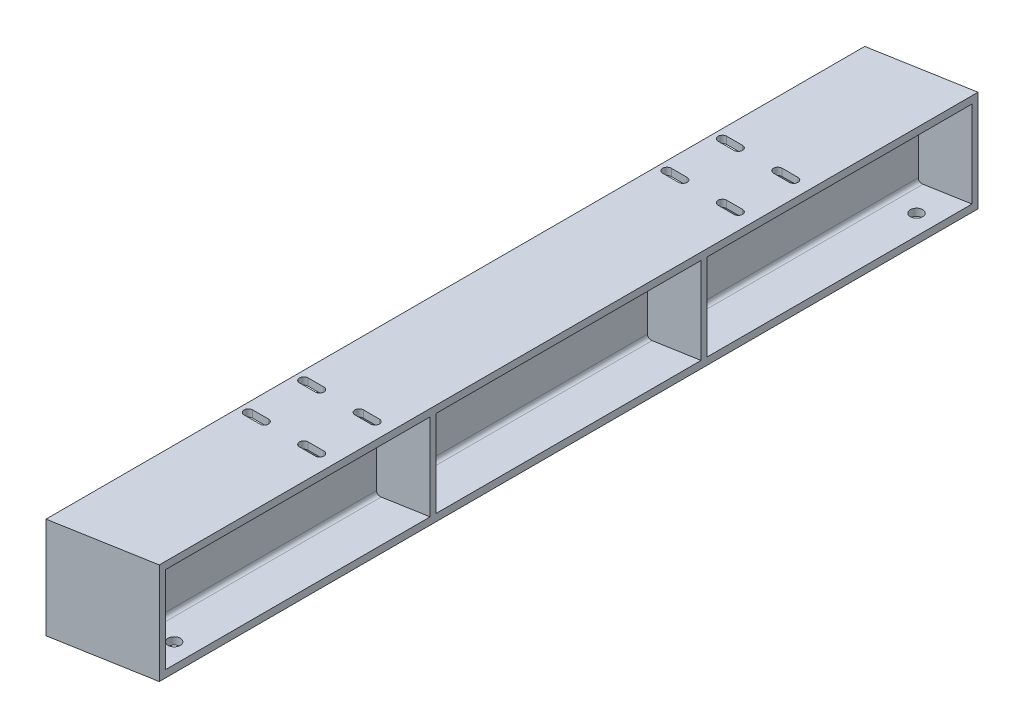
ISO-10303-21;
HEADER;
FILE_DESCRIPTION(('STEP AP214'),'2;1');
FILE_NAME('part.step','',(''),(''),'','','');
FILE_SCHEMA(('AUTOMOTIVE_DESIGN { 1 0 10303 214 1 1 1 1 }'));
ENDSEC;
DATA;
#1=APPLICATION_CONTEXT('core data for automotive mechanical design processes');
#2=APPLICATION_PROTOCOL_DEFINITION('international standard','automotive_design',2000,#1);
#3=PRODUCT_CONTEXT('',#1,'mechanical');
#4=PRODUCT('Part','Part','',(#3));
#5=PRODUCT_RELATED_PRODUCT_CATEGORY('part','',(#4));
#6=PRODUCT_DEFINITION_FORMATION('','',#4);
#7=PRODUCT_DEFINITION_CONTEXT('part definition',#1,'design');
#8=PRODUCT_DEFINITION('design','',#6,#7);
#9=PRODUCT_DEFINITION_SHAPE('','',#8);
#10=(LENGTH_UNIT() NAMED_UNIT(*) SI_UNIT(.MILLI.,.METRE.));
#11=(NAMED_UNIT(*) PLANE_ANGLE_UNIT() SI_UNIT($,.RADIAN.));
#12=(NAMED_UNIT(*) SI_UNIT($,.STERADIAN.) SOLID_ANGLE_UNIT());
#13=UNCERTAINTY_MEASURE_WITH_UNIT(LENGTH_MEASURE(1.E-05),#10,'distance_accuracy_value','');
#14=(GEOMETRIC_REPRESENTATION_CONTEXT(3) GLOBAL_UNCERTAINTY_ASSIGNED_CONTEXT((#13)) GLOBAL_UNIT_ASSIGNED_CONTEXT((#10,
#11,#12)) REPRESENTATION_CONTEXT('',''));
#15=CARTESIAN_POINT('',(0.,0.,0.));
#16=DIRECTION('',(0.,0.,1.));
#17=DIRECTION('',(1.,0.,0.));
#18=AXIS2_PLACEMENT_3D('',#15,#16,#17);
#19=CARTESIAN_POINT('',(0.,11.557,-670.179));
#20=DIRECTION('',(0.,1.,0.));
#21=DIRECTION('',(-1.,0.,0.));
#22=AXIS2_PLACEMENT_3D('',#19,#20,#21);
#23=PLANE('',#22);
#24=CARTESIAN_POINT('',(31.75,11.557,603.383340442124));
#25=DIRECTION('',(0.,1.,0.));
#26=DIRECTION('',(0.,0.,1.));
#27=AXIS2_PLACEMENT_3D('',#24,#25,#26);
#28=CIRCLE('',#27,9.92123999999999);
#29=CARTESIAN_POINT('',(31.75,11.557,613.304580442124));
#30=VERTEX_POINT('',#29);
#31=EDGE_CURVE('E750',#30,#30,#28,.T.);
#32=ORIENTED_EDGE('',*,*,#31,.F.);
#33=EDGE_LOOP('',(#32));
#34=FACE_BOUND('',#33,.T.);
#35=DIRECTION('',(-0.984809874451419,0.,0.173636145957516));
#36=VECTOR('',#35,1.);
#37=CARTESIAN_POINT('',(227.55532908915,11.557,620.44360530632));
#38=LINE('',#37,#36);
#39=CARTESIAN_POINT('',(66.802,11.557,648.786729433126));
#40=VERTEX_POINT('',#39);
#41=CARTESIAN_POINT('',(0.,11.557,660.564882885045));
#42=VERTEX_POINT('',#41);
#43=EDGE_CURVE('E813',#40,#42,#38,.T.);
#44=ORIENTED_EDGE('',*,*,#43,.F.);
#45=DIRECTION('',(0.,0.,1.));
#46=VECTOR('',#45,1.);
#47=CARTESIAN_POINT('',(66.802,11.557,-670.179));
#48=LINE('',#47,#46);
#49=CARTESIAN_POINT('',(66.802,11.557,223.953547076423));
#50=VERTEX_POINT('',#49);
#51=EDGE_CURVE('E979',#50,#40,#48,.T.);
#52=ORIENTED_EDGE('',*,*,#51,.F.);
#53=DIRECTION('',(0.984809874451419,0.,-0.173636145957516));
#54=VECTOR('',#53,1.);
#55=CARTESIAN_POINT('',(154.909453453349,11.557,208.418935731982));
#56=LINE('',#55,#54);
#57=CARTESIAN_POINT('',(0.,11.557,235.731700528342));
#58=VERTEX_POINT('',#57);
#59=EDGE_CURVE('E875',#58,#50,#56,.T.);
#60=ORIENTED_EDGE('',*,*,#59,.F.);
#61=DIRECTION('',(0.,0.,1.));
#62=VECTOR('',#61,1.);
#63=CARTESIAN_POINT('',(0.,11.557,-670.179));
#64=LINE('',#63,#62);
#65=EDGE_CURVE('E974',#58,#42,#64,.T.);
#66=ORIENTED_EDGE('',*,*,#65,.T.);
#67=EDGE_LOOP('',(#44,#52,#60,#66));
#68=FACE_BOUND('',#67,.T.);
#69=ADVANCED_FACE('F34',(#34,#68),#23,.T.);
#70=CARTESIAN_POINT('',(66.802,17.907,-670.179));
#71=DIRECTION('',(0.,0.,1.));
#72=DIRECTION('',(1.,0.,0.));
#73=AXIS2_PLACEMENT_3D('',#70,#71,#72);
#74=CYLINDRICAL_SURFACE('',#73,6.35);
#75=CARTESIAN_POINT('',(66.802,17.907,648.786729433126));
#76=DIRECTION('',(-0.173636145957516,0.,-0.984809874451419));
#77=DIRECTION('',(-0.984809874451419,0.,0.173636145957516));
#78=AXIS2_PLACEMENT_3D('',#75,#76,#77);
#79=ELLIPSE('',#78,6.44794509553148,6.35);
#80=CARTESIAN_POINT('',(73.152,17.907,647.667133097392));
#81=VERTEX_POINT('',#80);
#82=EDGE_CURVE('E810',#81,#40,#79,.T.);
#83=ORIENTED_EDGE('',*,*,#82,.F.);
#84=DIRECTION('',(0.,0.,1.));
#85=VECTOR('',#84,1.);
#86=CARTESIAN_POINT('',(73.152,17.907,-670.179));
#87=LINE('',#86,#85);
#88=CARTESIAN_POINT('',(73.152,17.907,222.833950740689));
#89=VERTEX_POINT('',#88);
#90=EDGE_CURVE('E984',#89,#81,#87,.T.);
#91=ORIENTED_EDGE('',*,*,#90,.F.);
#92=CARTESIAN_POINT('',(66.802,17.907,223.953547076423));
#93=DIRECTION('',(0.173636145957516,0.,0.984809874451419));
#94=DIRECTION('',(-0.984809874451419,0.,0.173636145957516));
#95=AXIS2_PLACEMENT_3D('',#92,#93,#94);
#96=ELLIPSE('',#95,6.44794509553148,6.35);
#97=EDGE_CURVE('E873',#50,#89,#96,.T.);
#98=ORIENTED_EDGE('',*,*,#97,.F.);
#99=ORIENTED_EDGE('',*,*,#51,.T.);
#100=EDGE_LOOP('',(#83,#91,#98,#99));
#101=FACE_BOUND('',#100,.T.);
#102=ADVANCED_FACE('F1082',(#101),#74,.F.);
#103=CARTESIAN_POINT('',(73.152,17.907,-670.179));
#104=DIRECTION('',(-1.,0.,0.));
#105=DIRECTION('',(0.,-1.,0.));
#106=AXIS2_PLACEMENT_3D('',#103,#104,#105);
#107=PLANE('',#106);
#108=DIRECTION('',(0.,-1.,0.));
#109=VECTOR('',#108,1.);
#110=CARTESIAN_POINT('',(73.152,17.9069999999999,647.667133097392));
#111=LINE('',#110,#109);
#112=CARTESIAN_POINT('',(73.152,144.145,647.667133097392));
#113=VERTEX_POINT('',#112);
#114=EDGE_CURVE('E807',#113,#81,#111,.T.);
#115=ORIENTED_EDGE('',*,*,#114,.F.);
#116=DIRECTION('',(0.,0.,1.));
#117=VECTOR('',#116,1.);
#118=CARTESIAN_POINT('',(73.152,144.145,-670.179));
#119=LINE('',#118,#117);
#120=CARTESIAN_POINT('',(73.152,144.145,222.833950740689));
#121=VERTEX_POINT('',#120);
#122=EDGE_CURVE('E989',#121,#113,#119,.T.);
#123=ORIENTED_EDGE('',*,*,#122,.F.);
#124=DIRECTION('',(0.,1.,0.));
#125=VECTOR('',#124,1.);
#126=CARTESIAN_POINT('',(73.152,17.9069999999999,222.833950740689));
#127=LINE('',#126,#125);
#128=EDGE_CURVE('E871',#89,#121,#127,.T.);
#129=ORIENTED_EDGE('',*,*,#128,.F.);
#130=ORIENTED_EDGE('',*,*,#90,.T.);
#131=EDGE_LOOP('',(#115,#123,#129,#130));
#132=FACE_BOUND('',#131,.T.);
#133=ADVANCED_FACE('F1090',(#132),#107,.T.);
#134=CARTESIAN_POINT('',(66.802,144.145,-670.179));
#135=DIRECTION('',(0.,0.,1.));
#136=DIRECTION('',(1.,0.,0.));
#137=AXIS2_PLACEMENT_3D('',#134,#135,#136);
#138=CYLINDRICAL_SURFACE('',#137,6.34999999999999);
#139=CARTESIAN_POINT('',(66.802,144.145,648.786729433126));
#140=DIRECTION('',(-0.173636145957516,0.,-0.984809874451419));
#141=DIRECTION('',(-0.984809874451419,0.,0.173636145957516));
#142=AXIS2_PLACEMENT_3D('',#139,#140,#141);
#143=ELLIPSE('',#142,6.44794509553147,6.34999999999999);
#144=CARTESIAN_POINT('',(66.802,150.495,648.786729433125));
#145=VERTEX_POINT('',#144);
#146=EDGE_CURVE('E804',#145,#113,#143,.T.);
#147=ORIENTED_EDGE('',*,*,#146,.F.);
#148=DIRECTION('',(0.,0.,1.));
#149=VECTOR('',#148,1.);
#150=CARTESIAN_POINT('',(66.802,150.495,-670.179));
#151=LINE('',#150,#149);
#152=CARTESIAN_POINT('',(66.8019999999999,150.495,223.953547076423));
#153=VERTEX_POINT('',#152);
#154=EDGE_CURVE('E994',#153,#145,#151,.T.);
#155=ORIENTED_EDGE('',*,*,#154,.F.);
#156=CARTESIAN_POINT('',(66.802,144.145,223.953547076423));
#157=DIRECTION('',(0.173636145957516,0.,0.984809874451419));
#158=DIRECTION('',(-0.984809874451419,0.,0.173636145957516));
#159=AXIS2_PLACEMENT_3D('',#156,#157,#158);
#160=ELLIPSE('',#159,6.44794509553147,6.34999999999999);
#161=EDGE_CURVE('E869',#121,#153,#160,.T.);
#162=ORIENTED_EDGE('',*,*,#161,.F.);
#163=ORIENTED_EDGE('',*,*,#122,.T.);
#164=EDGE_LOOP('',(#147,#155,#162,#163));
#165=FACE_BOUND('',#164,.T.);
#166=ADVANCED_FACE('F1275',(#165),#138,.F.);
#167=CARTESIAN_POINT('',(66.802,150.495,-670.179));
#168=DIRECTION('',(0.,-1.,0.));
#169=DIRECTION('',(0.,0.,-1.));
#170=AXIS2_PLACEMENT_3D('',#167,#168,#169);
#171=PLANE('',#170);
#172=DIRECTION('',(-0.999999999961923,0.,-8.72663709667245E-06));
#173=VECTOR('',#172,1.);
#174=CARTESIAN_POINT('',(39.444422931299,150.495,263.858892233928));
#175=LINE('',#174,#173);
#176=CARTESIAN_POINT('',(39.444422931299,150.495,263.858892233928));
#177=VERTEX_POINT('',#176);
#178=CARTESIAN_POINT('',(14.0444229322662,150.495,263.858670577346));
#179=VERTEX_POINT('',#178);
#180=EDGE_CURVE('E683',#177,#179,#175,.T.);
#181=ORIENTED_EDGE('',*,*,#180,.T.);
#182=CARTESIAN_POINT('',(14.0443623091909,150.495,270.805570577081));
#183=DIRECTION('',(0.,-1.,0.));
#184=DIRECTION('',(0.,0.,-1.));
#185=AXIS2_PLACEMENT_3D('',#182,#183,#184);
#186=CIRCLE('',#185,6.9469000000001);
#187=CARTESIAN_POINT('',(14.0443016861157,150.495,277.752470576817));
#188=VERTEX_POINT('',#187);
#189=EDGE_CURVE('E704',#179,#188,#186,.F.);
#190=ORIENTED_EDGE('',*,*,#189,.T.);
#191=DIRECTION('',(0.999999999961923,0.,8.72663709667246E-06));
#192=VECTOR('',#191,1.);
#193=CARTESIAN_POINT('',(39.4443016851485,150.495,277.752692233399));
#194=LINE('',#193,#192);
#195=CARTESIAN_POINT('',(39.4443016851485,150.495,277.752692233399));
#196=VERTEX_POINT('',#195);
#197=EDGE_CURVE('E700',#188,#196,#194,.T.);
#198=ORIENTED_EDGE('',*,*,#197,.T.);
#199=CARTESIAN_POINT('',(39.4443623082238,150.495,270.805792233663));
#200=DIRECTION('',(0.,-1.,0.));
#201=DIRECTION('',(0.,0.,-1.));
#202=AXIS2_PLACEMENT_3D('',#199,#200,#201);
#203=CIRCLE('',#202,6.9469000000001);
#204=EDGE_CURVE('E695',#196,#177,#203,.F.);
#205=ORIENTED_EDGE('',*,*,#204,.T.);
#206=EDGE_LOOP('',(#181,#190,#198,#205));
#207=FACE_BOUND('',#206,.T.);
#208=DIRECTION('',(-0.999999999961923,0.,-8.72663709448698E-06));
#209=VECTOR('',#208,1.);
#210=CARTESIAN_POINT('',(39.4436471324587,150.495,352.758890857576));
#211=LINE('',#210,#209);
#212=CARTESIAN_POINT('',(39.4436471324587,150.495,352.758890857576));
#213=VERTEX_POINT('',#212);
#214=CARTESIAN_POINT('',(14.0436471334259,150.495,352.758669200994));
#215=VERTEX_POINT('',#214);
#216=EDGE_CURVE('E715',#213,#215,#211,.T.);
#217=ORIENTED_EDGE('',*,*,#216,.T.);
#218=CARTESIAN_POINT('',(14.0435865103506,150.495,359.705569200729));
#219=DIRECTION('',(0.,-1.,0.));
#220=DIRECTION('',(0.,0.,-1.));
#221=AXIS2_PLACEMENT_3D('',#218,#219,#220);
#222=CIRCLE('',#221,6.94689999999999);
#223=CARTESIAN_POINT('',(14.0435258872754,150.495,366.652469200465));
#224=VERTEX_POINT('',#223);
#225=EDGE_CURVE('E736',#215,#224,#222,.F.);
#226=ORIENTED_EDGE('',*,*,#225,.T.);
#227=DIRECTION('',(0.999999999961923,0.,8.72663709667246E-06));
#228=VECTOR('',#227,1.);
#229=CARTESIAN_POINT('',(39.4435258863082,150.495,366.652690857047));
#230=LINE('',#229,#228);
#231=CARTESIAN_POINT('',(39.4435258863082,150.495,366.652690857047));
#232=VERTEX_POINT('',#231);
#233=EDGE_CURVE('E732',#224,#232,#230,.T.);
#234=ORIENTED_EDGE('',*,*,#233,.T.);
#235=CARTESIAN_POINT('',(39.4435865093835,150.495,359.705790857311));
#236=DIRECTION('',(0.,-1.,0.));
#237=DIRECTION('',(0.,0.,-1.));
#238=AXIS2_PLACEMENT_3D('',#235,#236,#237);
#239=CIRCLE('',#238,6.94690000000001);
#240=EDGE_CURVE('E727',#232,#213,#239,.F.);
#241=ORIENTED_EDGE('',*,*,#240,.T.);
#242=EDGE_LOOP('',(#217,#226,#234,#241));
#243=FACE_BOUND('',#242,.T.);
#244=DIRECTION('',(0.984809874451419,0.,-0.173636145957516));
#245=VECTOR('',#244,1.);
#246=CARTESIAN_POINT('',(292.343281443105,150.495,609.020557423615));
#247=LINE('',#246,#245);
#248=CARTESIAN_POINT('',(0.,150.495,660.564882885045));
#249=VERTEX_POINT('',#248);
#250=EDGE_CURVE('E801',#249,#145,#247,.T.);
#251=ORIENTED_EDGE('',*,*,#250,.F.);
#252=DIRECTION('',(0.,0.,1.));
#253=VECTOR('',#252,1.);
#254=CARTESIAN_POINT('',(0.,150.495,-670.179));
#255=LINE('',#254,#253);
#256=CARTESIAN_POINT('',(0.,150.495,235.731700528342));
#257=VERTEX_POINT('',#256);
#258=EDGE_CURVE('E999',#257,#249,#255,.T.);
#259=ORIENTED_EDGE('',*,*,#258,.F.);
#260=DIRECTION('',(-0.984809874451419,0.,0.173636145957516));
#261=VECTOR('',#260,1.);
#262=CARTESIAN_POINT('',(219.697405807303,150.495,196.995887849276));
#263=LINE('',#262,#261);
#264=EDGE_CURVE('E866',#153,#257,#263,.T.);
#265=ORIENTED_EDGE('',*,*,#264,.F.);
#266=ORIENTED_EDGE('',*,*,#154,.T.);
#267=EDGE_LOOP('',(#251,#259,#265,#266));
#268=FACE_BOUND('',#267,.T.);
#269=ADVANCED_FACE('F1267',(#207,#243,#268),#171,.T.);
#270=CARTESIAN_POINT('',(154.432,150.495,-670.179));
#271=DIRECTION('',(0.,-1.,0.));
#272=DIRECTION('',(0.,0.,-1.));
#273=AXIS2_PLACEMENT_3D('',#270,#271,#272);
#274=PLANE('',#273);
#275=DIRECTION('',(-0.999999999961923,0.,-8.72663709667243E-06));
#276=VECTOR('',#275,1.);
#277=CARTESIAN_POINT('',(128.344422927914,150.495,263.85966803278));
#278=LINE('',#277,#276);
#279=CARTESIAN_POINT('',(128.344422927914,150.495,263.85966803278));
#280=VERTEX_POINT('',#279);
#281=CARTESIAN_POINT('',(102.944422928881,150.495,263.859446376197));
#282=VERTEX_POINT('',#281);
#283=EDGE_CURVE('E619',#280,#282,#278,.T.);
#284=ORIENTED_EDGE('',*,*,#283,.T.);
#285=CARTESIAN_POINT('',(102.944362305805,150.495,270.806346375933));
#286=DIRECTION('',(0.,-1.,0.));
#287=DIRECTION('',(0.,0.,-1.));
#288=AXIS2_PLACEMENT_3D('',#285,#286,#287);
#289=CIRCLE('',#288,6.94690000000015);
#290=CARTESIAN_POINT('',(102.94430168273,150.495,277.753246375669));
#291=VERTEX_POINT('',#290);
#292=EDGE_CURVE('E640',#282,#291,#289,.F.);
#293=ORIENTED_EDGE('',*,*,#292,.T.);
#294=DIRECTION('',(0.999999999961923,0.,8.72663709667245E-06));
#295=VECTOR('',#294,1.);
#296=CARTESIAN_POINT('',(128.344301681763,150.495,277.753468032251));
#297=LINE('',#296,#295);
#298=CARTESIAN_POINT('',(128.344301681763,150.495,277.753468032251));
#299=VERTEX_POINT('',#298);
#300=EDGE_CURVE('E636',#291,#299,#297,.T.);
#301=ORIENTED_EDGE('',*,*,#300,.T.);
#302=CARTESIAN_POINT('',(128.344362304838,150.495,270.806568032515));
#303=DIRECTION('',(0.,-1.,0.));
#304=DIRECTION('',(0.,0.,-1.));
#305=AXIS2_PLACEMENT_3D('',#302,#303,#304);
#306=CIRCLE('',#305,6.94690000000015);
#307=EDGE_CURVE('E631',#299,#280,#306,.F.);
#308=ORIENTED_EDGE('',*,*,#307,.T.);
#309=EDGE_LOOP('',(#284,#293,#301,#308));
#310=FACE_BOUND('',#309,.T.);
#311=DIRECTION('',(-0.999999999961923,0.,-8.72663709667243E-06));
#312=VECTOR('',#311,1.);
#313=CARTESIAN_POINT('',(128.343647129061,150.495,352.759668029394));
#314=LINE('',#313,#312);
#315=CARTESIAN_POINT('',(128.343647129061,150.495,352.759668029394));
#316=VERTEX_POINT('',#315);
#317=CARTESIAN_POINT('',(102.943647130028,150.495,352.759446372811));
#318=VERTEX_POINT('',#317);
#319=EDGE_CURVE('E651',#316,#318,#314,.T.);
#320=ORIENTED_EDGE('',*,*,#319,.T.);
#321=CARTESIAN_POINT('',(102.943586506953,150.495,359.706346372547));
#322=DIRECTION('',(0.,-1.,0.));
#323=DIRECTION('',(0.,0.,-1.));
#324=AXIS2_PLACEMENT_3D('',#321,#322,#323);
#325=CIRCLE('',#324,6.94690000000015);
#326=CARTESIAN_POINT('',(102.943525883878,150.495,366.653246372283));
#327=VERTEX_POINT('',#326);
#328=EDGE_CURVE('E672',#318,#327,#325,.F.);
#329=ORIENTED_EDGE('',*,*,#328,.T.);
#330=DIRECTION('',(0.999999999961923,0.,8.72663709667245E-06));
#331=VECTOR('',#330,1.);
#332=CARTESIAN_POINT('',(128.343525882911,150.495,366.653468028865));
#333=LINE('',#332,#331);
#334=CARTESIAN_POINT('',(128.343525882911,150.495,366.653468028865));
#335=VERTEX_POINT('',#334);
#336=EDGE_CURVE('E668',#327,#335,#333,.T.);
#337=ORIENTED_EDGE('',*,*,#336,.T.);
#338=CARTESIAN_POINT('',(128.343586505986,150.495,359.706568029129));
#339=DIRECTION('',(0.,-1.,0.));
#340=DIRECTION('',(0.,0.,-1.));
#341=AXIS2_PLACEMENT_3D('',#338,#339,#340);
#342=CIRCLE('',#341,6.94690000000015);
#343=EDGE_CURVE('E663',#335,#316,#342,.F.);
#344=ORIENTED_EDGE('',*,*,#343,.T.);
#345=EDGE_LOOP('',(#320,#329,#337,#344));
#346=FACE_BOUND('',#345,.T.);
#347=DIRECTION('',(0.984809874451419,0.,-0.173636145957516));
#348=VECTOR('',#347,1.);
#349=CARTESIAN_POINT('',(377.33127977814,150.495,594.035950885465));
#350=LINE('',#349,#348);
#351=CARTESIAN_POINT('',(87.63,150.495,645.114453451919));
#352=VERTEX_POINT('',#351);
#353=CARTESIAN_POINT('',(154.432,150.495,633.3363));
#354=VERTEX_POINT('',#353);
#355=EDGE_CURVE('E798',#352,#354,#350,.T.);
#356=ORIENTED_EDGE('',*,*,#355,.F.);
#357=DIRECTION('',(0.,0.,1.));
#358=VECTOR('',#357,1.);
#359=CARTESIAN_POINT('',(87.63,150.495,-670.179));
#360=LINE('',#359,#358);
#361=CARTESIAN_POINT('',(87.63,150.495,220.281271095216));
#362=VERTEX_POINT('',#361);
#363=EDGE_CURVE('E1012',#362,#352,#360,.T.);
#364=ORIENTED_EDGE('',*,*,#363,.F.);
#365=DIRECTION('',(-0.984809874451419,0.,0.173636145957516));
#366=VECTOR('',#365,1.);
#367=CARTESIAN_POINT('',(304.685404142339,150.495,182.011281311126));
#368=LINE('',#367,#366);
#369=CARTESIAN_POINT('',(154.432,150.495,208.503117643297));
#370=VERTEX_POINT('',#369);
#371=EDGE_CURVE('E863',#370,#362,#368,.T.);
#372=ORIENTED_EDGE('',*,*,#371,.F.);
#373=DIRECTION('',(0.,0.,1.));
#374=VECTOR('',#373,1.);
#375=CARTESIAN_POINT('',(154.432,150.495,-670.179));
#376=LINE('',#375,#374);
#377=EDGE_CURVE('E1007',#370,#354,#376,.T.);
#378=ORIENTED_EDGE('',*,*,#377,.T.);
#379=EDGE_LOOP('',(#356,#364,#372,#378));
#380=FACE_BOUND('',#379,.T.);
#381=ADVANCED_FACE('F1265',(#310,#346,#380),#274,.T.);
#382=CARTESIAN_POINT('',(87.63,144.145,-670.179));
#383=DIRECTION('',(0.,0.,1.));
#384=DIRECTION('',(1.,0.,0.));
#385=AXIS2_PLACEMENT_3D('',#382,#383,#384);
#386=CYLINDRICAL_SURFACE('',#385,6.34999999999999);
#387=CARTESIAN_POINT('',(87.63,144.145,645.114453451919));
#388=DIRECTION('',(-0.173636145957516,0.,-0.984809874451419));
#389=DIRECTION('',(-0.984809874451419,0.,0.173636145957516));
#390=AXIS2_PLACEMENT_3D('',#387,#388,#389);
#391=ELLIPSE('',#390,6.44794509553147,6.34999999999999);
#392=CARTESIAN_POINT('',(81.28,144.145,646.234049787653));
#393=VERTEX_POINT('',#392);
#394=EDGE_CURVE('E795',#393,#352,#391,.T.);
#395=ORIENTED_EDGE('',*,*,#394,.F.);
#396=DIRECTION('',(0.,0.,1.));
#397=VECTOR('',#396,1.);
#398=CARTESIAN_POINT('',(81.28,144.145,-670.179));
#399=LINE('',#398,#397);
#400=CARTESIAN_POINT('',(81.28,144.145,221.40086743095));
#401=VERTEX_POINT('',#400);
#402=EDGE_CURVE('E1017',#401,#393,#399,.T.);
#403=ORIENTED_EDGE('',*,*,#402,.F.);
#404=CARTESIAN_POINT('',(87.63,144.145,220.281271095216));
#405=DIRECTION('',(0.173636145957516,0.,0.984809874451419));
#406=DIRECTION('',(-0.984809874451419,0.,0.173636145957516));
#407=AXIS2_PLACEMENT_3D('',#404,#405,#406);
#408=ELLIPSE('',#407,6.44794509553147,6.34999999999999);
#409=EDGE_CURVE('E860',#362,#401,#408,.T.);
#410=ORIENTED_EDGE('',*,*,#409,.F.);
#411=ORIENTED_EDGE('',*,*,#363,.T.);
#412=EDGE_LOOP('',(#395,#403,#410,#411));
#413=FACE_BOUND('',#412,.T.);
#414=ADVANCED_FACE('F1260',(#413),#386,.F.);
#415=CARTESIAN_POINT('',(81.28,144.145,-670.179));
#416=DIRECTION('',(1.,0.,0.));
#417=DIRECTION('',(0.,1.,0.));
#418=AXIS2_PLACEMENT_3D('',#415,#416,#417);
#419=PLANE('',#418);
#420=DIRECTION('',(0.,1.,0.));
#421=VECTOR('',#420,1.);
#422=CARTESIAN_POINT('',(81.28,144.145,646.234049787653));
#423=LINE('',#422,#421);
#424=CARTESIAN_POINT('',(81.28,17.907,646.234049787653));
#425=VERTEX_POINT('',#424);
#426=EDGE_CURVE('E792',#425,#393,#423,.T.);
#427=ORIENTED_EDGE('',*,*,#426,.F.);
#428=DIRECTION('',(0.,0.,1.));
#429=VECTOR('',#428,1.);
#430=CARTESIAN_POINT('',(81.28,17.907,-670.179));
#431=LINE('',#430,#429);
#432=CARTESIAN_POINT('',(81.28,17.907,221.40086743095));
#433=VERTEX_POINT('',#432);
#434=EDGE_CURVE('E1022',#433,#425,#431,.T.);
#435=ORIENTED_EDGE('',*,*,#434,.F.);
#436=DIRECTION('',(0.,-1.,0.));
#437=VECTOR('',#436,1.);
#438=CARTESIAN_POINT('',(81.28,144.145,221.40086743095));
#439=LINE('',#438,#437);
#440=EDGE_CURVE('E857',#401,#433,#439,.T.);
#441=ORIENTED_EDGE('',*,*,#440,.F.);
#442=ORIENTED_EDGE('',*,*,#402,.T.);
#443=EDGE_LOOP('',(#427,#435,#441,#442));
#444=FACE_BOUND('',#443,.T.);
#445=ADVANCED_FACE('F1075',(#444),#419,.T.);
#446=CARTESIAN_POINT('',(87.63,17.907,-670.179));
#447=DIRECTION('',(0.,0.,1.));
#448=DIRECTION('',(1.,0.,0.));
#449=AXIS2_PLACEMENT_3D('',#446,#447,#448);
#450=CYLINDRICAL_SURFACE('',#449,6.34999999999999);
#451=CARTESIAN_POINT('',(87.63,17.907,645.114453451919));
#452=DIRECTION('',(-0.173636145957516,0.,-0.984809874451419));
#453=DIRECTION('',(-0.984809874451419,0.,0.173636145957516));
#454=AXIS2_PLACEMENT_3D('',#451,#452,#453);
#455=ELLIPSE('',#454,6.44794509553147,6.34999999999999);
#456=CARTESIAN_POINT('',(87.63,11.557,645.114453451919));
#457=VERTEX_POINT('',#456);
#458=EDGE_CURVE('E789',#457,#425,#455,.T.);
#459=ORIENTED_EDGE('',*,*,#458,.F.);
#460=DIRECTION('',(0.,0.,1.));
#461=VECTOR('',#460,1.);
#462=CARTESIAN_POINT('',(87.63,11.557,-670.179));
#463=LINE('',#462,#461);
#464=CARTESIAN_POINT('',(87.63,11.557,220.281271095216));
#465=VERTEX_POINT('',#464);
#466=EDGE_CURVE('E1026',#465,#457,#463,.T.);
#467=ORIENTED_EDGE('',*,*,#466,.F.);
#468=CARTESIAN_POINT('',(87.63,17.907,220.281271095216));
#469=DIRECTION('',(0.173636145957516,0.,0.984809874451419));
#470=DIRECTION('',(-0.984809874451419,0.,0.173636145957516));
#471=AXIS2_PLACEMENT_3D('',#468,#469,#470);
#472=ELLIPSE('',#471,6.44794509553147,6.34999999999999);
#473=EDGE_CURVE('E854',#433,#465,#472,.T.);
#474=ORIENTED_EDGE('',*,*,#473,.F.);
#475=ORIENTED_EDGE('',*,*,#434,.T.);
#476=EDGE_LOOP('',(#459,#467,#474,#475));
#477=FACE_BOUND('',#476,.T.);
#478=ADVANCED_FACE('F1064',(#477),#450,.F.);
#479=CARTESIAN_POINT('',(87.63,11.557,-670.179));
#480=DIRECTION('',(0.,1.,0.));
#481=DIRECTION('',(-1.,0.,0.));
#482=AXIS2_PLACEMENT_3D('',#479,#480,#481);
#483=PLANE('',#482);
#484=CARTESIAN_POINT('',(122.682,11.557,587.350720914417));
#485=DIRECTION('',(0.,1.,0.));
#486=DIRECTION('',(0.,0.,1.));
#487=AXIS2_PLACEMENT_3D('',#484,#485,#486);
#488=CIRCLE('',#487,9.92124);
#489=CARTESIAN_POINT('',(122.682,11.557,597.271960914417));
#490=VERTEX_POINT('',#489);
#491=EDGE_CURVE('E756',#490,#490,#488,.T.);
#492=ORIENTED_EDGE('',*,*,#491,.F.);
#493=EDGE_LOOP('',(#492));
#494=FACE_BOUND('',#493,.T.);
#495=DIRECTION('',(-0.984809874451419,0.,0.173636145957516));
#496=VECTOR('',#495,1.);
#497=CARTESIAN_POINT('',(312.543327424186,11.5569999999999,605.45899876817));
#498=LINE('',#497,#496);
#499=CARTESIAN_POINT('',(154.432,11.557,633.3363));
#500=VERTEX_POINT('',#499);
#501=EDGE_CURVE('E786',#500,#457,#498,.T.);
#502=ORIENTED_EDGE('',*,*,#501,.F.);
#503=DIRECTION('',(0.,0.,1.));
#504=VECTOR('',#503,1.);
#505=CARTESIAN_POINT('',(154.432,11.557,-670.179));
#506=LINE('',#505,#504);
#507=CARTESIAN_POINT('',(154.432,11.557,208.503117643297));
#508=VERTEX_POINT('',#507);
#509=EDGE_CURVE('E1031',#508,#500,#506,.T.);
#510=ORIENTED_EDGE('',*,*,#509,.F.);
#511=DIRECTION('',(0.984809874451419,0.,-0.173636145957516));
#512=VECTOR('',#511,1.);
#513=CARTESIAN_POINT('',(239.897451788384,11.557,193.434329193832));
#514=LINE('',#513,#512);
#515=EDGE_CURVE('E851',#465,#508,#514,.T.);
#516=ORIENTED_EDGE('',*,*,#515,.F.);
#517=ORIENTED_EDGE('',*,*,#466,.T.);
#518=EDGE_LOOP('',(#502,#510,#516,#517));
#519=FACE_BOUND('',#518,.T.);
#520=ADVANCED_FACE('F1072',(#494,#519),#483,.T.);
#521=DIRECTION('',(-0.984809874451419,0.,0.173636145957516));
#522=VECTOR('',#521,1.);
#523=CARTESIAN_POINT('',(153.255569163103,11.557,199.038621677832));
#524=LINE('',#523,#522);
#525=CARTESIAN_POINT('',(66.802,11.557,214.281629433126));
#526=VERTEX_POINT('',#525);
#527=CARTESIAN_POINT('',(0.,11.557,226.059782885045));
#528=VERTEX_POINT('',#527);
#529=EDGE_CURVE('E849',#526,#528,#524,.T.);
#530=ORIENTED_EDGE('',*,*,#529,.F.);
#531=CARTESIAN_POINT('',(66.802,11.557,-210.551552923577));
#532=VERTEX_POINT('',#531);
#533=EDGE_CURVE('E978',#532,#526,#48,.T.);
#534=ORIENTED_EDGE('',*,*,#533,.F.);
#535=DIRECTION('',(0.984809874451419,0.,-0.173636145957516));
#536=VECTOR('',#535,1.);
#537=CARTESIAN_POINT('',(80.6096935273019,11.557,-212.986047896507));
#538=LINE('',#537,#536);
#539=CARTESIAN_POINT('',(0.,11.557,-198.773399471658));
#540=VERTEX_POINT('',#539);
#541=EDGE_CURVE('E930',#540,#532,#538,.T.);
#542=ORIENTED_EDGE('',*,*,#541,.F.);
#543=EDGE_CURVE('E973',#540,#528,#64,.T.);
#544=ORIENTED_EDGE('',*,*,#543,.T.);
#545=EDGE_LOOP('',(#530,#534,#542,#544));
#546=FACE_BOUND('',#545,.T.);
#547=ADVANCED_FACE('F1085',(#546),#23,.T.);
#548=CARTESIAN_POINT('',(66.802,17.907,214.281629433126));
#549=DIRECTION('',(-0.173636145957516,0.,-0.984809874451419));
#550=DIRECTION('',(-0.984809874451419,0.,0.173636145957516));
#551=AXIS2_PLACEMENT_3D('',#548,#549,#550);
#552=ELLIPSE('',#551,6.44794509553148,6.35);
#553=CARTESIAN_POINT('',(73.152,17.907,213.162033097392));
#554=VERTEX_POINT('',#553);
#555=EDGE_CURVE('E847',#554,#526,#552,.T.);
#556=ORIENTED_EDGE('',*,*,#555,.F.);
#557=CARTESIAN_POINT('',(73.152,17.907,-211.671149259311));
#558=VERTEX_POINT('',#557);
#559=EDGE_CURVE('E983',#558,#554,#87,.T.);
#560=ORIENTED_EDGE('',*,*,#559,.F.);
#561=CARTESIAN_POINT('',(66.802,17.907,-210.551552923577));
#562=DIRECTION('',(0.173636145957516,0.,0.984809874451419));
#563=DIRECTION('',(-0.984809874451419,0.,0.173636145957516));
#564=AXIS2_PLACEMENT_3D('',#561,#562,#563);
#565=ELLIPSE('',#564,6.44794509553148,6.35);
#566=EDGE_CURVE('E928',#532,#558,#565,.T.);
#567=ORIENTED_EDGE('',*,*,#566,.F.);
#568=ORIENTED_EDGE('',*,*,#533,.T.);
#569=EDGE_LOOP('',(#556,#560,#567,#568));
#570=FACE_BOUND('',#569,.T.);
#571=ADVANCED_FACE('F1093',(#570),#74,.F.);
#572=DIRECTION('',(0.,-1.,0.));
#573=VECTOR('',#572,1.);
#574=CARTESIAN_POINT('',(73.152,17.9069999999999,213.162033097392));
#575=LINE('',#574,#573);
#576=CARTESIAN_POINT('',(73.152,144.145,213.162033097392));
#577=VERTEX_POINT('',#576);
#578=EDGE_CURVE('E845',#577,#554,#575,.T.);
#579=ORIENTED_EDGE('',*,*,#578,.F.);
#580=CARTESIAN_POINT('',(73.152,144.145,-211.671149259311));
#581=VERTEX_POINT('',#580);
#582=EDGE_CURVE('E988',#581,#577,#119,.T.);
#583=ORIENTED_EDGE('',*,*,#582,.F.);
#584=DIRECTION('',(0.,1.,0.));
#585=VECTOR('',#584,1.);
#586=CARTESIAN_POINT('',(73.152,17.907,-211.671149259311));
#587=LINE('',#586,#585);
#588=EDGE_CURVE('E926',#558,#581,#587,.T.);
#589=ORIENTED_EDGE('',*,*,#588,.F.);
#590=ORIENTED_EDGE('',*,*,#559,.T.);
#591=EDGE_LOOP('',(#579,#583,#589,#590));
#592=FACE_BOUND('',#591,.T.);
#593=ADVANCED_FACE('F1299',(#592),#107,.T.);
#594=CARTESIAN_POINT('',(66.802,144.145,214.281629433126));
#595=DIRECTION('',(-0.173636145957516,0.,-0.984809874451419));
#596=DIRECTION('',(-0.984809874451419,0.,0.173636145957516));
#597=AXIS2_PLACEMENT_3D('',#594,#595,#596);
#598=ELLIPSE('',#597,6.44794509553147,6.34999999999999);
#599=CARTESIAN_POINT('',(66.8019999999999,150.495,214.281629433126));
#600=VERTEX_POINT('',#599);
#601=EDGE_CURVE('E843',#600,#577,#598,.T.);
#602=ORIENTED_EDGE('',*,*,#601,.F.);
#603=CARTESIAN_POINT('',(66.8019999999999,150.495,-210.551552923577));
#604=VERTEX_POINT('',#603);
#605=EDGE_CURVE('E993',#604,#600,#151,.T.);
#606=ORIENTED_EDGE('',*,*,#605,.F.);
#607=CARTESIAN_POINT('',(66.802,144.145,-210.551552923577));
#608=DIRECTION('',(0.173636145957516,0.,0.984809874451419));
#609=DIRECTION('',(-0.984809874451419,0.,0.173636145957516));
#610=AXIS2_PLACEMENT_3D('',#607,#608,#609);
#611=ELLIPSE('',#610,6.44794509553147,6.34999999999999);
#612=EDGE_CURVE('E924',#581,#604,#611,.T.);
#613=ORIENTED_EDGE('',*,*,#612,.F.);
#614=ORIENTED_EDGE('',*,*,#582,.T.);
#615=EDGE_LOOP('',(#602,#606,#613,#614));
#616=FACE_BOUND('',#615,.T.);
#617=ADVANCED_FACE('F1297',(#616),#138,.F.);
#618=DIRECTION('',(0.984809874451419,0.,-0.173636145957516));
#619=VECTOR('',#618,1.);
#620=CARTESIAN_POINT('',(218.043521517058,150.495,187.615573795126));
#621=LINE('',#620,#619);
#622=CARTESIAN_POINT('',(0.,150.495,226.059782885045));
#623=VERTEX_POINT('',#622);
#624=EDGE_CURVE('E841',#623,#600,#621,.T.);
#625=ORIENTED_EDGE('',*,*,#624,.F.);
#626=CARTESIAN_POINT('',(0.,150.495,-198.773399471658));
#627=VERTEX_POINT('',#626);
#628=EDGE_CURVE('E998',#627,#623,#255,.T.);
#629=ORIENTED_EDGE('',*,*,#628,.F.);
#630=DIRECTION('',(-0.984809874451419,0.,0.173636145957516));
#631=VECTOR('',#630,1.);
#632=CARTESIAN_POINT('',(145.397645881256,150.495,-224.409095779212));
#633=LINE('',#632,#631);
#634=EDGE_CURVE('E921',#604,#627,#633,.T.);
#635=ORIENTED_EDGE('',*,*,#634,.F.);
#636=ORIENTED_EDGE('',*,*,#605,.T.);
#637=EDGE_LOOP('',(#625,#629,#635,#636));
#638=FACE_BOUND('',#637,.T.);
#639=ADVANCED_FACE('F1278',(#638),#171,.T.);
#640=DIRECTION('',(0.984809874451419,0.,-0.173636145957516));
#641=VECTOR('',#640,1.);
#642=CARTESIAN_POINT('',(303.031519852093,150.495,172.630967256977));
#643=LINE('',#642,#641);
#644=CARTESIAN_POINT('',(87.63,150.495,210.609353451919));
#645=VERTEX_POINT('',#644);
#646=CARTESIAN_POINT('',(154.432,150.495,198.8312));
#647=VERTEX_POINT('',#646);
#648=EDGE_CURVE('E838',#645,#647,#643,.T.);
#649=ORIENTED_EDGE('',*,*,#648,.F.);
#650=CARTESIAN_POINT('',(87.63,150.495,-214.223828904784));
#651=VERTEX_POINT('',#650);
#652=EDGE_CURVE('E1011',#651,#645,#360,.T.);
#653=ORIENTED_EDGE('',*,*,#652,.F.);
#654=DIRECTION('',(-0.984809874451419,0.,0.173636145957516));
#655=VECTOR('',#654,1.);
#656=CARTESIAN_POINT('',(230.385644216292,150.495,-239.393702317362));
#657=LINE('',#656,#655);
#658=CARTESIAN_POINT('',(154.432,150.495,-226.001982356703));
#659=VERTEX_POINT('',#658);
#660=EDGE_CURVE('E918',#659,#651,#657,.T.);
#661=ORIENTED_EDGE('',*,*,#660,.F.);
#662=EDGE_CURVE('E1006',#659,#647,#376,.T.);
#663=ORIENTED_EDGE('',*,*,#662,.T.);
#664=EDGE_LOOP('',(#649,#653,#661,#663));
#665=FACE_BOUND('',#664,.T.);
#666=ADVANCED_FACE('F1238',(#665),#274,.T.);
#667=CARTESIAN_POINT('',(87.63,144.145,210.609353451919));
#668=DIRECTION('',(-0.173636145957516,0.,-0.984809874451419));
#669=DIRECTION('',(-0.984809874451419,0.,0.173636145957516));
#670=AXIS2_PLACEMENT_3D('',#667,#668,#669);
#671=ELLIPSE('',#670,6.44794509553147,6.34999999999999);
#672=CARTESIAN_POINT('',(81.28,144.145,211.728949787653));
#673=VERTEX_POINT('',#672);
#674=EDGE_CURVE('E835',#673,#645,#671,.T.);
#675=ORIENTED_EDGE('',*,*,#674,.F.);
#676=CARTESIAN_POINT('',(81.28,144.145,-213.10423256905));
#677=VERTEX_POINT('',#676);
#678=EDGE_CURVE('E1016',#677,#673,#399,.T.);
#679=ORIENTED_EDGE('',*,*,#678,.F.);
#680=CARTESIAN_POINT('',(87.63,144.145,-214.223828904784));
#681=DIRECTION('',(0.173636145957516,0.,0.984809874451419));
#682=DIRECTION('',(-0.984809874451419,0.,0.173636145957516));
#683=AXIS2_PLACEMENT_3D('',#680,#681,#682);
#684=ELLIPSE('',#683,6.44794509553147,6.34999999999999);
#685=EDGE_CURVE('E915',#651,#677,#684,.T.);
#686=ORIENTED_EDGE('',*,*,#685,.F.);
#687=ORIENTED_EDGE('',*,*,#652,.T.);
#688=EDGE_LOOP('',(#675,#679,#686,#687));
#689=FACE_BOUND('',#688,.T.);
#690=ADVANCED_FACE('F1264',(#689),#386,.F.);
#691=DIRECTION('',(0.,1.,0.));
#692=VECTOR('',#691,1.);
#693=CARTESIAN_POINT('',(81.28,144.145,211.728949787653));
#694=LINE('',#693,#692);
#695=CARTESIAN_POINT('',(81.28,17.907,211.728949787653));
#696=VERTEX_POINT('',#695);
#697=EDGE_CURVE('E832',#696,#673,#694,.T.);
#698=ORIENTED_EDGE('',*,*,#697,.F.);
#699=CARTESIAN_POINT('',(81.28,17.907,-213.10423256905));
#700=VERTEX_POINT('',#699);
#701=EDGE_CURVE('E1021',#700,#696,#431,.T.);
#702=ORIENTED_EDGE('',*,*,#701,.F.);
#703=DIRECTION('',(0.,-1.,0.));
#704=VECTOR('',#703,1.);
#705=CARTESIAN_POINT('',(81.28,144.145,-213.10423256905));
#706=LINE('',#705,#704);
#707=EDGE_CURVE('E912',#677,#700,#706,.T.);
#708=ORIENTED_EDGE('',*,*,#707,.F.);
#709=ORIENTED_EDGE('',*,*,#678,.T.);
#710=EDGE_LOOP('',(#698,#702,#708,#709));
#711=FACE_BOUND('',#710,.T.);
#712=ADVANCED_FACE('F1076',(#711),#419,.T.);
#713=CARTESIAN_POINT('',(87.63,17.907,210.609353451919));
#714=DIRECTION('',(-0.173636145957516,0.,-0.984809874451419));
#715=DIRECTION('',(-0.984809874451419,0.,0.173636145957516));
#716=AXIS2_PLACEMENT_3D('',#713,#714,#715);
#717=ELLIPSE('',#716,6.44794509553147,6.34999999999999);
#718=CARTESIAN_POINT('',(87.63,11.557,210.609353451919));
#719=VERTEX_POINT('',#718);
#720=EDGE_CURVE('E829',#719,#696,#717,.T.);
#721=ORIENTED_EDGE('',*,*,#720,.F.);
#722=CARTESIAN_POINT('',(87.63,11.557,-214.223828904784));
#723=VERTEX_POINT('',#722);
#724=EDGE_CURVE('E1025',#723,#719,#463,.T.);
#725=ORIENTED_EDGE('',*,*,#724,.F.);
#726=CARTESIAN_POINT('',(87.63,17.907,-214.223828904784));
#727=DIRECTION('',(0.173636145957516,0.,0.984809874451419));
#728=DIRECTION('',(-0.984809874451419,0.,0.173636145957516));
#729=AXIS2_PLACEMENT_3D('',#726,#727,#728);
#730=ELLIPSE('',#729,6.44794509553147,6.34999999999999);
#731=EDGE_CURVE('E909',#700,#723,#730,.T.);
#732=ORIENTED_EDGE('',*,*,#731,.F.);
#733=ORIENTED_EDGE('',*,*,#701,.T.);
#734=EDGE_LOOP('',(#721,#725,#732,#733));
#735=FACE_BOUND('',#734,.T.);
#736=ADVANCED_FACE('F1065',(#735),#450,.F.);
#737=DIRECTION('',(-0.984809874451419,0.,0.173636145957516));
#738=VECTOR('',#737,1.);
#739=CARTESIAN_POINT('',(238.243567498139,11.557,184.054015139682));
#740=LINE('',#739,#738);
#741=CARTESIAN_POINT('',(154.432,11.557,198.8312));
#742=VERTEX_POINT('',#741);
#743=EDGE_CURVE('E826',#742,#719,#740,.T.);
#744=ORIENTED_EDGE('',*,*,#743,.F.);
#745=CARTESIAN_POINT('',(154.432,11.557,-226.001982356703));
#746=VERTEX_POINT('',#745);
#747=EDGE_CURVE('E1030',#746,#742,#506,.T.);
#748=ORIENTED_EDGE('',*,*,#747,.F.);
#749=DIRECTION('',(0.984809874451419,0.,-0.173636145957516));
#750=VECTOR('',#749,1.);
#751=CARTESIAN_POINT('',(165.597691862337,11.557,-227.970654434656));
#752=LINE('',#751,#750);
#753=EDGE_CURVE('E11',#723,#746,#752,.T.);
#754=ORIENTED_EDGE('',*,*,#753,.F.);
#755=ORIENTED_EDGE('',*,*,#724,.T.);
#756=EDGE_LOOP('',(#744,#748,#754,#755));
#757=FACE_BOUND('',#756,.T.);
#758=ADVANCED_FACE('F1073',(#757),#483,.T.);
#759=CARTESIAN_POINT('',(154.432,0.,-670.179));
#760=DIRECTION('',(0.,-1.,0.));
#761=DIRECTION('',(0.,0.,-1.));
#762=AXIS2_PLACEMENT_3D('',#759,#760,#761);
#763=PLANE('',#762);
#764=CARTESIAN_POINT('',(31.75,0.,-587.292920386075));
#765=DIRECTION('',(0.,1.,0.));
#766=DIRECTION('',(0.,0.,1.));
#767=AXIS2_PLACEMENT_3D('',#764,#765,#766);
#768=CIRCLE('',#767,9.92124);
#769=CARTESIAN_POINT('',(31.75,0.,-577.371680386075));
#770=VERTEX_POINT('',#769);
#771=EDGE_CURVE('E747',#770,#770,#768,.T.);
#772=ORIENTED_EDGE('',*,*,#771,.T.);
#773=EDGE_LOOP('',(#772));
#774=FACE_BOUND('',#773,.T.);
#775=CARTESIAN_POINT('',(31.75,0.,603.383340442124));
#776=DIRECTION('',(0.,1.,0.));
#777=DIRECTION('',(0.,0.,1.));
#778=AXIS2_PLACEMENT_3D('',#775,#776,#777);
#779=CIRCLE('',#778,9.92124);
#780=CARTESIAN_POINT('',(31.75,0.,613.304580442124));
#781=VERTEX_POINT('',#780);
#782=EDGE_CURVE('E753',#781,#781,#779,.T.);
#783=ORIENTED_EDGE('',*,*,#782,.T.);
#784=EDGE_LOOP('',(#783));
#785=FACE_BOUND('',#784,.T.);
#786=CARTESIAN_POINT('',(122.682,0.,587.350720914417));
#787=DIRECTION('',(0.,1.,0.));
#788=DIRECTION('',(0.,0.,1.));
#789=AXIS2_PLACEMENT_3D('',#786,#787,#788);
#790=CIRCLE('',#789,9.92124);
#791=CARTESIAN_POINT('',(122.682,0.,597.271960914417));
#792=VERTEX_POINT('',#791);
#793=EDGE_CURVE('E759',#792,#792,#790,.T.);
#794=ORIENTED_EDGE('',*,*,#793,.T.);
#795=EDGE_LOOP('',(#794));
#796=FACE_BOUND('',#795,.T.);
#797=CARTESIAN_POINT('',(122.682,0.,-603.325539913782));
#798=DIRECTION('',(0.,1.,0.));
#799=DIRECTION('',(0.,0.,1.));
#800=AXIS2_PLACEMENT_3D('',#797,#798,#799);
#801=CIRCLE('',#800,9.92124);
#802=CARTESIAN_POINT('',(122.682,0.,-593.404299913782));
#803=VERTEX_POINT('',#802);
#804=EDGE_CURVE('E765',#803,#803,#801,.T.);
#805=ORIENTED_EDGE('',*,*,#804,.T.);
#806=EDGE_LOOP('',(#805));
#807=FACE_BOUND('',#806,.T.);
#808=DIRECTION('',(0.,0.,1.));
#809=VECTOR('',#808,1.);
#810=CARTESIAN_POINT('',(154.432,0.,-670.179));
#811=LINE('',#810,#809);
#812=CARTESIAN_POINT('',(154.432,0.,-670.179));
#813=VERTEX_POINT('',#812);
#814=CARTESIAN_POINT('',(154.432,0.,643.008217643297));
#815=VERTEX_POINT('',#814);
#816=EDGE_CURVE('E967',#813,#815,#811,.T.);
#817=ORIENTED_EDGE('',*,*,#816,.T.);
#818=DIRECTION('',(0.984809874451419,0.,-0.173636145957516));
#819=VECTOR('',#818,1.);
#820=CARTESIAN_POINT('',(154.432,0.,643.008217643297));
#821=LINE('',#820,#819);
#822=CARTESIAN_POINT('',(0.,0.,670.236800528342));
#823=VERTEX_POINT('',#822);
#824=EDGE_CURVE('E771',#823,#815,#821,.T.);
#825=ORIENTED_EDGE('',*,*,#824,.F.);
#826=DIRECTION('',(0.,0.,1.));
#827=VECTOR('',#826,1.);
#828=CARTESIAN_POINT('',(0.,0.,-670.179));
#829=LINE('',#828,#827);
#830=CARTESIAN_POINT('',(0.,0.,-642.950417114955));
#831=VERTEX_POINT('',#830);
#832=EDGE_CURVE('E968',#831,#823,#829,.T.);
#833=ORIENTED_EDGE('',*,*,#832,.F.);
#834=DIRECTION('',(0.984809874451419,0.,-0.173636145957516));
#835=VECTOR('',#834,1.);
#836=CARTESIAN_POINT('',(154.432,0.,-670.179));
#837=LINE('',#836,#835);
#838=EDGE_CURVE('E958',#831,#813,#837,.T.);
#839=ORIENTED_EDGE('',*,*,#838,.T.);
#840=EDGE_LOOP('',(#817,#825,#833,#839));
#841=FACE_BOUND('',#840,.T.);
#842=ADVANCED_FACE('F36',(#774,#785,#796,#807,#841),#763,.T.);
#843=CARTESIAN_POINT('',(0.,0.,-670.179));
#844=DIRECTION('',(-1.,0.,0.));
#845=DIRECTION('',(0.,-1.,0.));
#846=AXIS2_PLACEMENT_3D('',#843,#844,#845);
#847=PLANE('',#846);
#848=ORIENTED_EDGE('',*,*,#258,.T.);
#849=DIRECTION('',(0.,1.,0.));
#850=VECTOR('',#849,1.);
#851=CARTESIAN_POINT('',(0.,-158.779373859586,660.564882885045));
#852=LINE('',#851,#850);
#853=EDGE_CURVE('E775',#42,#249,#852,.T.);
#854=ORIENTED_EDGE('',*,*,#853,.F.);
#855=ORIENTED_EDGE('',*,*,#65,.F.);
#856=DIRECTION('',(0.,1.,0.));
#857=VECTOR('',#856,1.);
#858=CARTESIAN_POINT('',(0.,-158.779373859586,235.731700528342));
#859=LINE('',#858,#857);
#860=EDGE_CURVE('E819',#58,#257,#859,.T.);
#861=ORIENTED_EDGE('',*,*,#860,.T.);
#862=EDGE_LOOP('',(#848,#854,#855,#861));
#863=FACE_BOUND('',#862,.T.);
#864=DIRECTION('',(0.,1.,0.));
#865=VECTOR('',#864,1.);
#866=CARTESIAN_POINT('',(0.,-158.779373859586,670.236800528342));
#867=LINE('',#866,#865);
#868=CARTESIAN_POINT('',(0.,162.052,670.236800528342));
#869=VERTEX_POINT('',#868);
#870=EDGE_CURVE('E778',#823,#869,#867,.T.);
#871=ORIENTED_EDGE('',*,*,#870,.T.);
#872=DIRECTION('',(0.,0.,1.));
#873=VECTOR('',#872,1.);
#874=CARTESIAN_POINT('',(0.,162.052,-670.179));
#875=LINE('',#874,#873);
#876=CARTESIAN_POINT('',(0.,162.052,-642.950417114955));
#877=VERTEX_POINT('',#876);
#878=EDGE_CURVE('E1000',#877,#869,#875,.T.);
#879=ORIENTED_EDGE('',*,*,#878,.F.);
#880=DIRECTION('',(0.,1.,0.));
#881=VECTOR('',#880,1.);
#882=CARTESIAN_POINT('',(0.,0.,-642.950417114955));
#883=LINE('',#882,#881);
#884=EDGE_CURVE('E961',#831,#877,#883,.T.);
#885=ORIENTED_EDGE('',*,*,#884,.F.);
#886=ORIENTED_EDGE('',*,*,#832,.T.);
#887=EDGE_LOOP('',(#871,#879,#885,#886));
#888=FACE_BOUND('',#887,.T.);
#889=ORIENTED_EDGE('',*,*,#628,.T.);
#890=DIRECTION('',(0.,1.,0.));
#891=VECTOR('',#890,1.);
#892=CARTESIAN_POINT('',(0.,-158.779373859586,226.059782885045));
#893=LINE('',#892,#891);
#894=EDGE_CURVE('E817',#528,#623,#893,.T.);
#895=ORIENTED_EDGE('',*,*,#894,.F.);
#896=ORIENTED_EDGE('',*,*,#543,.F.);
#897=DIRECTION('',(0.,1.,0.));
#898=VECTOR('',#897,1.);
#899=CARTESIAN_POINT('',(0.,-158.779373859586,-198.773399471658));
#900=LINE('',#899,#898);
#901=EDGE_CURVE('E880',#540,#627,#900,.T.);
#902=ORIENTED_EDGE('',*,*,#901,.T.);
#903=EDGE_LOOP('',(#889,#895,#896,#902));
#904=FACE_BOUND('',#903,.T.);
#905=CARTESIAN_POINT('',(0.,150.495,-633.278499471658));
#906=VERTEX_POINT('',#905);
#907=CARTESIAN_POINT('',(0.,150.495,-208.445317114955));
#908=VERTEX_POINT('',#907);
#909=EDGE_CURVE('E995',#906,#908,#255,.T.);
#910=ORIENTED_EDGE('',*,*,#909,.T.);
#911=DIRECTION('',(0.,1.,0.));
#912=VECTOR('',#911,1.);
#913=CARTESIAN_POINT('',(0.,-158.779373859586,-208.445317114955));
#914=LINE('',#913,#912);
#915=CARTESIAN_POINT('',(0.,11.557,-208.445317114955));
#916=VERTEX_POINT('',#915);
#917=EDGE_CURVE('E878',#916,#908,#914,.T.);
#918=ORIENTED_EDGE('',*,*,#917,.F.);
#919=CARTESIAN_POINT('',(0.,11.557,-633.278499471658));
#920=VERTEX_POINT('',#919);
#921=EDGE_CURVE('E970',#920,#916,#64,.T.);
#922=ORIENTED_EDGE('',*,*,#921,.F.);
#923=DIRECTION('',(0.,1.,0.));
#924=VECTOR('',#923,1.);
#925=CARTESIAN_POINT('',(0.,-158.779373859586,-633.278499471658));
#926=LINE('',#925,#924);
#927=EDGE_CURVE('E934',#920,#906,#926,.T.);
#928=ORIENTED_EDGE('',*,*,#927,.T.);
#929=EDGE_LOOP('',(#910,#918,#922,#928));
#930=FACE_BOUND('',#929,.T.);
#931=ADVANCED_FACE('F1101',(#863,#888,#904,#930),#847,.T.);
#932=CARTESIAN_POINT('',(31.75,11.557,-587.292920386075));
#933=DIRECTION('',(0.,1.,0.));
#934=DIRECTION('',(0.,0.,1.));
#935=AXIS2_PLACEMENT_3D('',#932,#933,#934);
#936=CIRCLE('',#935,9.92123999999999);
#937=CARTESIAN_POINT('',(31.75,11.557,-577.371680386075));
#938=VERTEX_POINT('',#937);
#939=EDGE_CURVE('E744',#938,#938,#936,.T.);
#940=ORIENTED_EDGE('',*,*,#939,.F.);
#941=EDGE_LOOP('',(#940));
#942=FACE_BOUND('',#941,.T.);
#943=DIRECTION('',(-0.984809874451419,0.,0.173636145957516));
#944=VECTOR('',#943,1.);
#945=CARTESIAN_POINT('',(78.9558092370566,11.557,-222.366361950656));
#946=LINE('',#945,#944);
#947=CARTESIAN_POINT('',(66.802,11.557,-220.223470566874));
#948=VERTEX_POINT('',#947);
#949=EDGE_CURVE('E907',#948,#916,#946,.T.);
#950=ORIENTED_EDGE('',*,*,#949,.F.);
#951=CARTESIAN_POINT('',(66.802,11.557,-645.056652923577));
#952=VERTEX_POINT('',#951);
#953=EDGE_CURVE('E975',#952,#948,#48,.T.);
#954=ORIENTED_EDGE('',*,*,#953,.F.);
#955=DIRECTION('',(0.984809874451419,0.,-0.173636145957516));
#956=VECTOR('',#955,1.);
#957=CARTESIAN_POINT('',(6.30993360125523,11.557,-634.391031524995));
#958=LINE('',#957,#956);
#959=EDGE_CURVE('E955',#920,#952,#958,.T.);
#960=ORIENTED_EDGE('',*,*,#959,.F.);
#961=ORIENTED_EDGE('',*,*,#921,.T.);
#962=EDGE_LOOP('',(#950,#954,#960,#961));
#963=FACE_BOUND('',#962,.T.);
#964=ADVANCED_FACE('F1086',(#942,#963),#23,.T.);
#965=CARTESIAN_POINT('',(66.802,17.907,-220.223470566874));
#966=DIRECTION('',(-0.173636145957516,0.,-0.984809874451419));
#967=DIRECTION('',(-0.984809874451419,0.,0.173636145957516));
#968=AXIS2_PLACEMENT_3D('',#965,#966,#967);
#969=ELLIPSE('',#968,6.44794509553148,6.35);
#970=CARTESIAN_POINT('',(73.152,17.907,-221.343066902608));
#971=VERTEX_POINT('',#970);
#972=EDGE_CURVE('E905',#971,#948,#969,.T.);
#973=ORIENTED_EDGE('',*,*,#972,.F.);
#974=CARTESIAN_POINT('',(73.152,17.907,-646.176249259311));
#975=VERTEX_POINT('',#974);
#976=EDGE_CURVE('E980',#975,#971,#87,.T.);
#977=ORIENTED_EDGE('',*,*,#976,.F.);
#978=CARTESIAN_POINT('',(66.802,17.907,-645.056652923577));
#979=DIRECTION('',(0.173636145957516,0.,0.984809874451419));
#980=DIRECTION('',(-0.984809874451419,0.,0.173636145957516));
#981=AXIS2_PLACEMENT_3D('',#978,#979,#980);
#982=ELLIPSE('',#981,6.44794509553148,6.35);
#983=EDGE_CURVE('E953',#952,#975,#982,.T.);
#984=ORIENTED_EDGE('',*,*,#983,.F.);
#985=ORIENTED_EDGE('',*,*,#953,.T.);
#986=EDGE_LOOP('',(#973,#977,#984,#985));
#987=FACE_BOUND('',#986,.T.);
#988=ADVANCED_FACE('F1094',(#987),#74,.F.);
#989=DIRECTION('',(0.,-1.,0.));
#990=VECTOR('',#989,1.);
#991=CARTESIAN_POINT('',(73.152,17.907,-221.343066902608));
#992=LINE('',#991,#990);
#993=CARTESIAN_POINT('',(73.152,144.145,-221.343066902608));
#994=VERTEX_POINT('',#993);
#995=EDGE_CURVE('E903',#994,#971,#992,.T.);
#996=ORIENTED_EDGE('',*,*,#995,.F.);
#997=CARTESIAN_POINT('',(73.152,144.145,-646.176249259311));
#998=VERTEX_POINT('',#997);
#999=EDGE_CURVE('E985',#998,#994,#119,.T.);
#1000=ORIENTED_EDGE('',*,*,#999,.F.);
#1001=DIRECTION('',(0.,1.,0.));
#1002=VECTOR('',#1001,1.);
#1003=CARTESIAN_POINT('',(73.152,17.907,-646.176249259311));
#1004=LINE('',#1003,#1002);
#1005=EDGE_CURVE('E951',#975,#998,#1004,.T.);
#1006=ORIENTED_EDGE('',*,*,#1005,.F.);
#1007=ORIENTED_EDGE('',*,*,#976,.T.);
#1008=EDGE_LOOP('',(#996,#1000,#1006,#1007));
#1009=FACE_BOUND('',#1008,.T.);
#1010=ADVANCED_FACE('F1107',(#1009),#107,.T.);
#1011=CARTESIAN_POINT('',(66.802,144.145,-220.223470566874));
#1012=DIRECTION('',(-0.173636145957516,0.,-0.984809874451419));
#1013=DIRECTION('',(-0.984809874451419,0.,0.173636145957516));
#1014=AXIS2_PLACEMENT_3D('',#1011,#1012,#1013);
#1015=ELLIPSE('',#1014,6.44794509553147,6.34999999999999);
#1016=CARTESIAN_POINT('',(66.8019999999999,150.495,-220.223470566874));
#1017=VERTEX_POINT('',#1016);
#1018=EDGE_CURVE('E901',#1017,#994,#1015,.T.);
#1019=ORIENTED_EDGE('',*,*,#1018,.F.);
#1020=CARTESIAN_POINT('',(66.802,150.495,-645.056652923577));
#1021=VERTEX_POINT('',#1020);
#1022=EDGE_CURVE('E990',#1021,#1017,#151,.T.);
#1023=ORIENTED_EDGE('',*,*,#1022,.F.);
#1024=CARTESIAN_POINT('',(66.802,144.145,-645.056652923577));
#1025=DIRECTION('',(0.173636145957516,0.,0.984809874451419));
#1026=DIRECTION('',(-0.984809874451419,0.,0.173636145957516));
#1027=AXIS2_PLACEMENT_3D('',#1024,#1025,#1026);
#1028=ELLIPSE('',#1027,6.44794509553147,6.34999999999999);
#1029=EDGE_CURVE('E949',#998,#1021,#1028,.T.);
#1030=ORIENTED_EDGE('',*,*,#1029,.F.);
#1031=ORIENTED_EDGE('',*,*,#999,.T.);
#1032=EDGE_LOOP('',(#1019,#1023,#1030,#1031));
#1033=FACE_BOUND('',#1032,.T.);
#1034=ADVANCED_FACE('F1130',(#1033),#138,.F.);
#1035=DIRECTION('',(-0.999999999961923,0.,-8.72663709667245E-06));
#1036=VECTOR('',#1035,1.);
#1037=CARTESIAN_POINT('',(39.4502818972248,150.495,-407.529147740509));
#1038=LINE('',#1037,#1036);
#1039=CARTESIAN_POINT('',(39.4502818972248,150.495,-407.529147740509));
#1040=VERTEX_POINT('',#1039);
#1041=CARTESIAN_POINT('',(14.0502818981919,150.495,-407.529369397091));
#1042=VERTEX_POINT('',#1041);
#1043=EDGE_CURVE('E555',#1040,#1042,#1038,.T.);
#1044=ORIENTED_EDGE('',*,*,#1043,.T.);
#1045=CARTESIAN_POINT('',(14.0502212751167,150.495,-400.582469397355));
#1046=DIRECTION('',(0.,-1.,0.));
#1047=DIRECTION('',(0.,0.,-1.));
#1048=AXIS2_PLACEMENT_3D('',#1045,#1046,#1047);
#1049=CIRCLE('',#1048,6.9469000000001);
#1050=CARTESIAN_POINT('',(14.0501606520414,150.495,-393.63556939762));
#1051=VERTEX_POINT('',#1050);
#1052=EDGE_CURVE('E576',#1042,#1051,#1049,.F.);
#1053=ORIENTED_EDGE('',*,*,#1052,.T.);
#1054=DIRECTION('',(0.999999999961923,0.,8.72663709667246E-06));
#1055=VECTOR('',#1054,1.);
#1056=CARTESIAN_POINT('',(39.4501606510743,150.495,-393.635347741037));
#1057=LINE('',#1056,#1055);
#1058=CARTESIAN_POINT('',(39.4501606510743,150.495,-393.635347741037));
#1059=VERTEX_POINT('',#1058);
#1060=EDGE_CURVE('E572',#1051,#1059,#1057,.T.);
#1061=ORIENTED_EDGE('',*,*,#1060,.T.);
#1062=CARTESIAN_POINT('',(39.4502212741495,150.495,-400.582247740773));
#1063=DIRECTION('',(0.,-1.,0.));
#1064=DIRECTION('',(0.,0.,-1.));
#1065=AXIS2_PLACEMENT_3D('',#1062,#1063,#1064);
#1066=CIRCLE('',#1065,6.9469000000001);
#1067=EDGE_CURVE('E567',#1059,#1040,#1066,.F.);
#1068=ORIENTED_EDGE('',*,*,#1067,.T.);
#1069=EDGE_LOOP('',(#1044,#1053,#1061,#1068));
#1070=FACE_BOUND('',#1069,.T.);
#1071=DIRECTION('',(-0.999999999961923,0.,-8.72663709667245E-06));
#1072=VECTOR('',#1071,1.);
#1073=CARTESIAN_POINT('',(39.4495060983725,150.495,-318.629147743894));
#1074=LINE('',#1073,#1072);
#1075=CARTESIAN_POINT('',(39.4495060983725,150.495,-318.629147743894));
#1076=VERTEX_POINT('',#1075);
#1077=CARTESIAN_POINT('',(14.0495060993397,150.495,-318.629369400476));
#1078=VERTEX_POINT('',#1077);
#1079=EDGE_CURVE('E587',#1076,#1078,#1074,.T.);
#1080=ORIENTED_EDGE('',*,*,#1079,.T.);
#1081=CARTESIAN_POINT('',(14.0494454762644,150.495,-311.68246940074));
#1082=DIRECTION('',(0.,-1.,0.));
#1083=DIRECTION('',(0.,0.,-1.));
#1084=AXIS2_PLACEMENT_3D('',#1081,#1082,#1083);
#1085=CIRCLE('',#1084,6.9469000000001);
#1086=CARTESIAN_POINT('',(14.0493848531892,150.495,-304.735569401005));
#1087=VERTEX_POINT('',#1086);
#1088=EDGE_CURVE('E608',#1078,#1087,#1085,.F.);
#1089=ORIENTED_EDGE('',*,*,#1088,.T.);
#1090=DIRECTION('',(0.999999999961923,0.,8.72663709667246E-06));
#1091=VECTOR('',#1090,1.);
#1092=CARTESIAN_POINT('',(39.449384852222,150.495,-304.735347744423));
#1093=LINE('',#1092,#1091);
#1094=CARTESIAN_POINT('',(39.449384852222,150.495,-304.735347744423));
#1095=VERTEX_POINT('',#1094);
#1096=EDGE_CURVE('E604',#1087,#1095,#1093,.T.);
#1097=ORIENTED_EDGE('',*,*,#1096,.T.);
#1098=CARTESIAN_POINT('',(39.4494454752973,150.495,-311.682247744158));
#1099=DIRECTION('',(0.,-1.,0.));
#1100=DIRECTION('',(0.,0.,-1.));
#1101=AXIS2_PLACEMENT_3D('',#1098,#1099,#1100);
#1102=CIRCLE('',#1101,6.9469000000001);
#1103=EDGE_CURVE('E599',#1095,#1076,#1102,.F.);
#1104=ORIENTED_EDGE('',*,*,#1103,.T.);
#1105=EDGE_LOOP('',(#1080,#1089,#1097,#1104));
#1106=FACE_BOUND('',#1105,.T.);
#1107=DIRECTION('',(0.984809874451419,0.,-0.173636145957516));
#1108=VECTOR('',#1107,1.);
#1109=CARTESIAN_POINT('',(143.743761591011,150.495,-233.789409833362));
#1110=LINE('',#1109,#1108);
#1111=EDGE_CURVE('E899',#908,#1017,#1110,.T.);
#1112=ORIENTED_EDGE('',*,*,#1111,.F.);
#1113=ORIENTED_EDGE('',*,*,#909,.F.);
#1114=DIRECTION('',(-0.984809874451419,0.,0.173636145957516));
#1115=VECTOR('',#1114,1.);
#1116=CARTESIAN_POINT('',(71.0978859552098,150.495,-645.8140794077));
#1117=LINE('',#1116,#1115);
#1118=EDGE_CURVE('E946',#1021,#906,#1117,.T.);
#1119=ORIENTED_EDGE('',*,*,#1118,.F.);
#1120=ORIENTED_EDGE('',*,*,#1022,.T.);
#1121=EDGE_LOOP('',(#1112,#1113,#1119,#1120));
#1122=FACE_BOUND('',#1121,.T.);
#1123=ADVANCED_FACE('F1136',(#1070,#1106,#1122),#171,.T.);
#1124=CARTESIAN_POINT('',(0.,162.052,-670.179));
#1125=DIRECTION('',(0.,1.,0.));
#1126=DIRECTION('',(0.,0.,1.));
#1127=AXIS2_PLACEMENT_3D('',#1124,#1125,#1126);
#1128=PLANE('',#1127);
#1129=DIRECTION('',(-0.999999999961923,0.,-8.72663709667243E-06));
#1130=VECTOR('',#1129,1.);
#1131=CARTESIAN_POINT('',(128.35028189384,162.052,-407.528371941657));
#1132=LINE('',#1131,#1130);
#1133=CARTESIAN_POINT('',(128.35028189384,162.052,-407.528371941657));
#1134=VERTEX_POINT('',#1133);
#1135=CARTESIAN_POINT('',(102.950281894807,162.052,-407.528593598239));
#1136=VERTEX_POINT('',#1135);
#1137=EDGE_CURVE('E500',#1134,#1136,#1132,.T.);
#1138=ORIENTED_EDGE('',*,*,#1137,.F.);
#1139=CARTESIAN_POINT('',(128.350221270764,162.052,-400.581471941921));
#1140=DIRECTION('',(0.,1.,0.));
#1141=DIRECTION('',(0.,0.,1.));
#1142=AXIS2_PLACEMENT_3D('',#1139,#1140,#1141);
#1143=CIRCLE('',#1142,6.9469000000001);
#1144=CARTESIAN_POINT('',(128.350160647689,162.052,-393.634571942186));
#1145=VERTEX_POINT('',#1144);
#1146=EDGE_CURVE('E511',#1145,#1134,#1143,.T.);
#1147=ORIENTED_EDGE('',*,*,#1146,.F.);
#1148=DIRECTION('',(0.999999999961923,0.,8.72663709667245E-06));
#1149=VECTOR('',#1148,1.);
#1150=CARTESIAN_POINT('',(128.350160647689,162.052,-393.634571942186));
#1151=LINE('',#1150,#1149);
#1152=CARTESIAN_POINT('',(102.950160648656,162.052,-393.634793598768));
#1153=VERTEX_POINT('',#1152);
#1154=EDGE_CURVE('E49',#1153,#1145,#1151,.T.);
#1155=ORIENTED_EDGE('',*,*,#1154,.F.);
#1156=CARTESIAN_POINT('',(102.950221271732,162.052,-400.581693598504));
#1157=DIRECTION('',(0.,1.,0.));
#1158=DIRECTION('',(0.,0.,1.));
#1159=AXIS2_PLACEMENT_3D('',#1156,#1157,#1158);
#1160=CIRCLE('',#1159,6.9469000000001);
#1161=EDGE_CURVE('E507',#1136,#1153,#1160,.T.);
#1162=ORIENTED_EDGE('',*,*,#1161,.F.);
#1163=EDGE_LOOP('',(#1138,#1147,#1155,#1162));
#1164=FACE_BOUND('',#1163,.T.);
#1165=DIRECTION('',(-0.999999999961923,0.,-8.72663709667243E-06));
#1166=VECTOR('',#1165,1.);
#1167=CARTESIAN_POINT('',(128.349506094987,162.052,-318.628371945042));
#1168=LINE('',#1167,#1166);
#1169=CARTESIAN_POINT('',(128.349506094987,162.052,-318.628371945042));
#1170=VERTEX_POINT('',#1169);
#1171=CARTESIAN_POINT('',(102.949506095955,162.052,-318.628593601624));
#1172=VERTEX_POINT('',#1171);
#1173=EDGE_CURVE('E527',#1170,#1172,#1168,.T.);
#1174=ORIENTED_EDGE('',*,*,#1173,.F.);
#1175=CARTESIAN_POINT('',(128.349445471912,162.052,-311.681471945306));
#1176=DIRECTION('',(0.,1.,0.));
#1177=DIRECTION('',(0.,0.,1.));
#1178=AXIS2_PLACEMENT_3D('',#1175,#1176,#1177);
#1179=CIRCLE('',#1178,6.9469000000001);
#1180=CARTESIAN_POINT('',(128.349384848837,162.052,-304.734571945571));
#1181=VERTEX_POINT('',#1180);
#1182=EDGE_CURVE('E520',#1181,#1170,#1179,.T.);
#1183=ORIENTED_EDGE('',*,*,#1182,.F.);
#1184=DIRECTION('',(0.999999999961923,0.,8.72663709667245E-06));
#1185=VECTOR('',#1184,1.);
#1186=CARTESIAN_POINT('',(128.349384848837,162.052,-304.734571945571));
#1187=LINE('',#1186,#1185);
#1188=CARTESIAN_POINT('',(102.949384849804,162.052,-304.734793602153));
#1189=VERTEX_POINT('',#1188);
#1190=EDGE_CURVE('E521',#1189,#1181,#1187,.T.);
#1191=ORIENTED_EDGE('',*,*,#1190,.F.);
#1192=CARTESIAN_POINT('',(102.949445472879,162.052,-311.681693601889));
#1193=DIRECTION('',(0.,1.,0.));
#1194=DIRECTION('',(0.,0.,1.));
#1195=AXIS2_PLACEMENT_3D('',#1192,#1193,#1194);
#1196=CIRCLE('',#1195,6.9469000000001);
#1197=EDGE_CURVE('E524',#1172,#1189,#1196,.T.);
#1198=ORIENTED_EDGE('',*,*,#1197,.F.);
#1199=EDGE_LOOP('',(#1174,#1183,#1191,#1198));
#1200=FACE_BOUND('',#1199,.T.);
#1201=DIRECTION('',(-0.999999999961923,0.,-8.72663709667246E-06));
#1202=VECTOR('',#1201,1.);
#1203=CARTESIAN_POINT('',(39.4502818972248,162.052,-407.529147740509));
#1204=LINE('',#1203,#1202);
#1205=CARTESIAN_POINT('',(39.4502818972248,162.052,-407.529147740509));
#1206=VERTEX_POINT('',#1205);
#1207=CARTESIAN_POINT('',(14.0502818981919,162.052,-407.529369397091));
#1208=VERTEX_POINT('',#1207);
#1209=EDGE_CURVE('E559',#1206,#1208,#1204,.T.);
#1210=ORIENTED_EDGE('',*,*,#1209,.F.);
#1211=CARTESIAN_POINT('',(39.4502212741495,162.052,-400.582247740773));
#1212=DIRECTION('',(0.,1.,0.));
#1213=DIRECTION('',(0.,0.,1.));
#1214=AXIS2_PLACEMENT_3D('',#1211,#1212,#1213);
#1215=CIRCLE('',#1214,6.9469000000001);
#1216=CARTESIAN_POINT('',(39.4501606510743,162.052,-393.635347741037));
#1217=VERTEX_POINT('',#1216);
#1218=EDGE_CURVE('E552',#1217,#1206,#1215,.T.);
#1219=ORIENTED_EDGE('',*,*,#1218,.F.);
#1220=DIRECTION('',(0.999999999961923,0.,8.72663709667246E-06));
#1221=VECTOR('',#1220,1.);
#1222=CARTESIAN_POINT('',(39.4501606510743,162.052,-393.635347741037));
#1223=LINE('',#1222,#1221);
#1224=CARTESIAN_POINT('',(14.0501606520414,162.052,-393.63556939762));
#1225=VERTEX_POINT('',#1224);
#1226=EDGE_CURVE('E553',#1225,#1217,#1223,.T.);
#1227=ORIENTED_EDGE('',*,*,#1226,.F.);
#1228=CARTESIAN_POINT('',(14.0502212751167,162.052,-400.582469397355));
#1229=DIRECTION('',(0.,1.,0.));
#1230=DIRECTION('',(0.,0.,1.));
#1231=AXIS2_PLACEMENT_3D('',#1228,#1229,#1230);
#1232=CIRCLE('',#1231,6.9469000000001);
#1233=EDGE_CURVE('E556',#1208,#1225,#1232,.T.);
#1234=ORIENTED_EDGE('',*,*,#1233,.F.);
#1235=EDGE_LOOP('',(#1210,#1219,#1227,#1234));
#1236=FACE_BOUND('',#1235,.T.);
#1237=DIRECTION('',(-0.999999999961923,0.,-8.72663709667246E-06));
#1238=VECTOR('',#1237,1.);
#1239=CARTESIAN_POINT('',(39.4495060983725,162.052,-318.629147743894));
#1240=LINE('',#1239,#1238);
#1241=CARTESIAN_POINT('',(39.4495060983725,162.052,-318.629147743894));
#1242=VERTEX_POINT('',#1241);
#1243=CARTESIAN_POINT('',(14.0495060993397,162.052,-318.629369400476));
#1244=VERTEX_POINT('',#1243);
#1245=EDGE_CURVE('E591',#1242,#1244,#1240,.T.);
#1246=ORIENTED_EDGE('',*,*,#1245,.F.);
#1247=CARTESIAN_POINT('',(39.4494454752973,162.052,-311.682247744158));
#1248=DIRECTION('',(0.,1.,0.));
#1249=DIRECTION('',(0.,0.,1.));
#1250=AXIS2_PLACEMENT_3D('',#1247,#1248,#1249);
#1251=CIRCLE('',#1250,6.9469000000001);
#1252=CARTESIAN_POINT('',(39.449384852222,162.052,-304.735347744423));
#1253=VERTEX_POINT('',#1252);
#1254=EDGE_CURVE('E584',#1253,#1242,#1251,.T.);
#1255=ORIENTED_EDGE('',*,*,#1254,.F.);
#1256=DIRECTION('',(0.999999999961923,0.,8.72663709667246E-06));
#1257=VECTOR('',#1256,1.);
#1258=CARTESIAN_POINT('',(39.449384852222,162.052,-304.735347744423));
#1259=LINE('',#1258,#1257);
#1260=CARTESIAN_POINT('',(14.0493848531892,162.052,-304.735569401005));
#1261=VERTEX_POINT('',#1260);
#1262=EDGE_CURVE('E585',#1261,#1253,#1259,.T.);
#1263=ORIENTED_EDGE('',*,*,#1262,.F.);
#1264=CARTESIAN_POINT('',(14.0494454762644,162.052,-311.68246940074));
#1265=DIRECTION('',(0.,1.,0.));
#1266=DIRECTION('',(0.,0.,1.));
#1267=AXIS2_PLACEMENT_3D('',#1264,#1265,#1266);
#1268=CIRCLE('',#1267,6.9469000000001);
#1269=EDGE_CURVE('E588',#1244,#1261,#1268,.T.);
#1270=ORIENTED_EDGE('',*,*,#1269,.F.);
#1271=EDGE_LOOP('',(#1246,#1255,#1263,#1270));
#1272=FACE_BOUND('',#1271,.T.);
#1273=DIRECTION('',(-0.999999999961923,0.,-8.72663709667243E-06));
#1274=VECTOR('',#1273,1.);
#1275=CARTESIAN_POINT('',(128.344422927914,162.052,263.85966803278));
#1276=LINE('',#1275,#1274);
#1277=CARTESIAN_POINT('',(128.344422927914,162.052,263.85966803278));
#1278=VERTEX_POINT('',#1277);
#1279=CARTESIAN_POINT('',(102.944422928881,162.052,263.859446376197));
#1280=VERTEX_POINT('',#1279);
#1281=EDGE_CURVE('E623',#1278,#1280,#1276,.T.);
#1282=ORIENTED_EDGE('',*,*,#1281,.F.);
#1283=CARTESIAN_POINT('',(128.344362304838,162.052,270.806568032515));
#1284=DIRECTION('',(0.,1.,0.));
#1285=DIRECTION('',(0.,0.,1.));
#1286=AXIS2_PLACEMENT_3D('',#1283,#1284,#1285);
#1287=CIRCLE('',#1286,6.94690000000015);
#1288=CARTESIAN_POINT('',(128.344301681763,162.052,277.753468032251));
#1289=VERTEX_POINT('',#1288);
#1290=EDGE_CURVE('E616',#1289,#1278,#1287,.T.);
#1291=ORIENTED_EDGE('',*,*,#1290,.F.);
#1292=DIRECTION('',(0.999999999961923,0.,8.72663709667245E-06));
#1293=VECTOR('',#1292,1.);
#1294=CARTESIAN_POINT('',(128.344301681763,162.052,277.753468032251));
#1295=LINE('',#1294,#1293);
#1296=CARTESIAN_POINT('',(102.94430168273,162.052,277.753246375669));
#1297=VERTEX_POINT('',#1296);
#1298=EDGE_CURVE('E617',#1297,#1289,#1295,.T.);
#1299=ORIENTED_EDGE('',*,*,#1298,.F.);
#1300=CARTESIAN_POINT('',(102.944362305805,162.052,270.806346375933));
#1301=DIRECTION('',(0.,1.,0.));
#1302=DIRECTION('',(0.,0.,1.));
#1303=AXIS2_PLACEMENT_3D('',#1300,#1301,#1302);
#1304=CIRCLE('',#1303,6.94690000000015);
#1305=EDGE_CURVE('E620',#1280,#1297,#1304,.T.);
#1306=ORIENTED_EDGE('',*,*,#1305,.F.);
#1307=EDGE_LOOP('',(#1282,#1291,#1299,#1306));
#1308=FACE_BOUND('',#1307,.T.);
#1309=DIRECTION('',(-0.999999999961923,0.,-8.72663709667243E-06));
#1310=VECTOR('',#1309,1.);
#1311=CARTESIAN_POINT('',(128.343647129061,162.052,352.759668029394));
#1312=LINE('',#1311,#1310);
#1313=CARTESIAN_POINT('',(128.343647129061,162.052,352.759668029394));
#1314=VERTEX_POINT('',#1313);
#1315=CARTESIAN_POINT('',(102.943647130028,162.052,352.759446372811));
#1316=VERTEX_POINT('',#1315);
#1317=EDGE_CURVE('E655',#1314,#1316,#1312,.T.);
#1318=ORIENTED_EDGE('',*,*,#1317,.F.);
#1319=CARTESIAN_POINT('',(128.343586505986,162.052,359.706568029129));
#1320=DIRECTION('',(0.,1.,0.));
#1321=DIRECTION('',(0.,0.,1.));
#1322=AXIS2_PLACEMENT_3D('',#1319,#1320,#1321);
#1323=CIRCLE('',#1322,6.94690000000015);
#1324=CARTESIAN_POINT('',(128.343525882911,162.052,366.653468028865));
#1325=VERTEX_POINT('',#1324);
#1326=EDGE_CURVE('E648',#1325,#1314,#1323,.T.);
#1327=ORIENTED_EDGE('',*,*,#1326,.F.);
#1328=DIRECTION('',(0.999999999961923,0.,8.72663709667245E-06));
#1329=VECTOR('',#1328,1.);
#1330=CARTESIAN_POINT('',(128.343525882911,162.052,366.653468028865));
#1331=LINE('',#1330,#1329);
#1332=CARTESIAN_POINT('',(102.943525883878,162.052,366.653246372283));
#1333=VERTEX_POINT('',#1332);
#1334=EDGE_CURVE('E649',#1333,#1325,#1331,.T.);
#1335=ORIENTED_EDGE('',*,*,#1334,.F.);
#1336=CARTESIAN_POINT('',(102.943586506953,162.052,359.706346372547));
#1337=DIRECTION('',(0.,1.,0.));
#1338=DIRECTION('',(0.,0.,1.));
#1339=AXIS2_PLACEMENT_3D('',#1336,#1337,#1338);
#1340=CIRCLE('',#1339,6.94690000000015);
#1341=EDGE_CURVE('E652',#1316,#1333,#1340,.T.);
#1342=ORIENTED_EDGE('',*,*,#1341,.F.);
#1343=EDGE_LOOP('',(#1318,#1327,#1335,#1342));
#1344=FACE_BOUND('',#1343,.T.);
#1345=DIRECTION('',(-0.999999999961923,0.,-8.72663709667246E-06));
#1346=VECTOR('',#1345,1.);
#1347=CARTESIAN_POINT('',(39.444422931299,162.052,263.858892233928));
#1348=LINE('',#1347,#1346);
#1349=CARTESIAN_POINT('',(39.444422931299,162.052,263.858892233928));
#1350=VERTEX_POINT('',#1349);
#1351=CARTESIAN_POINT('',(14.0444229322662,162.052,263.858670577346));
#1352=VERTEX_POINT('',#1351);
#1353=EDGE_CURVE('E687',#1350,#1352,#1348,.T.);
#1354=ORIENTED_EDGE('',*,*,#1353,.F.);
#1355=CARTESIAN_POINT('',(39.4443623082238,162.052,270.805792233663));
#1356=DIRECTION('',(0.,1.,0.));
#1357=DIRECTION('',(0.,0.,1.));
#1358=AXIS2_PLACEMENT_3D('',#1355,#1356,#1357);
#1359=CIRCLE('',#1358,6.9469000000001);
#1360=CARTESIAN_POINT('',(39.4443016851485,162.052,277.752692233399));
#1361=VERTEX_POINT('',#1360);
#1362=EDGE_CURVE('E680',#1361,#1350,#1359,.T.);
#1363=ORIENTED_EDGE('',*,*,#1362,.F.);
#1364=DIRECTION('',(0.999999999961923,0.,8.72663709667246E-06));
#1365=VECTOR('',#1364,1.);
#1366=CARTESIAN_POINT('',(39.4443016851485,162.052,277.752692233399));
#1367=LINE('',#1366,#1365);
#1368=CARTESIAN_POINT('',(14.0443016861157,162.052,277.752470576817));
#1369=VERTEX_POINT('',#1368);
#1370=EDGE_CURVE('E681',#1369,#1361,#1367,.T.);
#1371=ORIENTED_EDGE('',*,*,#1370,.F.);
#1372=CARTESIAN_POINT('',(14.0443623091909,162.052,270.805570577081));
#1373=DIRECTION('',(0.,1.,0.));
#1374=DIRECTION('',(0.,0.,1.));
#1375=AXIS2_PLACEMENT_3D('',#1372,#1373,#1374);
#1376=CIRCLE('',#1375,6.9469000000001);
#1377=EDGE_CURVE('E684',#1352,#1369,#1376,.T.);
#1378=ORIENTED_EDGE('',*,*,#1377,.F.);
#1379=EDGE_LOOP('',(#1354,#1363,#1371,#1378));
#1380=FACE_BOUND('',#1379,.T.);
#1381=DIRECTION('',(-0.999999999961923,0.,-8.72663709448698E-06));
#1382=VECTOR('',#1381,1.);
#1383=CARTESIAN_POINT('',(39.4436471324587,162.052,352.758890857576));
#1384=LINE('',#1383,#1382);
#1385=CARTESIAN_POINT('',(39.4436471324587,162.052,352.758890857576));
#1386=VERTEX_POINT('',#1385);
#1387=CARTESIAN_POINT('',(14.0436471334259,162.052,352.758669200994));
#1388=VERTEX_POINT('',#1387);
#1389=EDGE_CURVE('E719',#1386,#1388,#1384,.T.);
#1390=ORIENTED_EDGE('',*,*,#1389,.F.);
#1391=CARTESIAN_POINT('',(39.4435865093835,162.052,359.705790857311));
#1392=DIRECTION('',(0.,1.,0.));
#1393=DIRECTION('',(0.,0.,1.));
#1394=AXIS2_PLACEMENT_3D('',#1391,#1392,#1393);
#1395=CIRCLE('',#1394,6.94690000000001);
#1396=CARTESIAN_POINT('',(39.4435258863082,162.052,366.652690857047));
#1397=VERTEX_POINT('',#1396);
#1398=EDGE_CURVE('E712',#1397,#1386,#1395,.T.);
#1399=ORIENTED_EDGE('',*,*,#1398,.F.);
#1400=DIRECTION('',(0.999999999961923,0.,8.72663709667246E-06));
#1401=VECTOR('',#1400,1.);
#1402=CARTESIAN_POINT('',(39.4435258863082,162.052,366.652690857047));
#1403=LINE('',#1402,#1401);
#1404=CARTESIAN_POINT('',(14.0435258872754,162.052,366.652469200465));
#1405=VERTEX_POINT('',#1404);
#1406=EDGE_CURVE('E713',#1405,#1397,#1403,.T.);
#1407=ORIENTED_EDGE('',*,*,#1406,.F.);
#1408=CARTESIAN_POINT('',(14.0435865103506,162.052,359.705569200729));
#1409=DIRECTION('',(0.,1.,0.));
#1410=DIRECTION('',(0.,0.,1.));
#1411=AXIS2_PLACEMENT_3D('',#1408,#1409,#1410);
#1412=CIRCLE('',#1411,6.94689999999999);
#1413=EDGE_CURVE('E716',#1388,#1405,#1412,.T.);
#1414=ORIENTED_EDGE('',*,*,#1413,.F.);
#1415=EDGE_LOOP('',(#1390,#1399,#1407,#1414));
#1416=FACE_BOUND('',#1415,.T.);
#1417=ORIENTED_EDGE('',*,*,#878,.T.);
#1418=DIRECTION('',(0.984809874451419,0.,-0.173636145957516));
#1419=VECTOR('',#1418,1.);
#1420=CARTESIAN_POINT('',(154.432,162.052,643.008217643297));
#1421=LINE('',#1420,#1419);
#1422=CARTESIAN_POINT('',(154.432,162.052,643.008217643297));
#1423=VERTEX_POINT('',#1422);
#1424=EDGE_CURVE('E768',#869,#1423,#1421,.T.);
#1425=ORIENTED_EDGE('',*,*,#1424,.T.);
#1426=DIRECTION('',(0.,0.,1.));
#1427=VECTOR('',#1426,1.);
#1428=CARTESIAN_POINT('',(154.432,162.052,-670.179));
#1429=LINE('',#1428,#1427);
#1430=CARTESIAN_POINT('',(154.432,162.052,-670.179));
#1431=VERTEX_POINT('',#1430);
#1432=EDGE_CURVE('E1002',#1431,#1423,#1429,.T.);
#1433=ORIENTED_EDGE('',*,*,#1432,.F.);
#1434=DIRECTION('',(0.984809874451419,0.,-0.173636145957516));
#1435=VECTOR('',#1434,1.);
#1436=CARTESIAN_POINT('',(154.432,162.052,-670.179));
#1437=LINE('',#1436,#1435);
#1438=EDGE_CURVE('E957',#877,#1431,#1437,.T.);
#1439=ORIENTED_EDGE('',*,*,#1438,.F.);
#1440=EDGE_LOOP('',(#1417,#1425,#1433,#1439));
#1441=FACE_BOUND('',#1440,.T.);
#1442=ADVANCED_FACE('F1177',(#1164,#1200,#1236,#1272,#1308,#1344,#1380,#1416,#1441),#1128,.T.);
#1443=CARTESIAN_POINT('',(154.432,162.052,-670.179));
#1444=DIRECTION('',(1.,0.,0.));
#1445=DIRECTION('',(0.,0.,-1.));
#1446=AXIS2_PLACEMENT_3D('',#1443,#1444,#1445);
#1447=PLANE('',#1446);
#1448=ORIENTED_EDGE('',*,*,#509,.T.);
#1449=DIRECTION('',(0.,1.,0.));
#1450=VECTOR('',#1449,1.);
#1451=CARTESIAN_POINT('',(154.432,-158.779373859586,633.3363));
#1452=LINE('',#1451,#1450);
#1453=EDGE_CURVE('E779',#500,#354,#1452,.T.);
#1454=ORIENTED_EDGE('',*,*,#1453,.T.);
#1455=ORIENTED_EDGE('',*,*,#377,.F.);
#1456=DIRECTION('',(0.,1.,0.));
#1457=VECTOR('',#1456,1.);
#1458=CARTESIAN_POINT('',(154.432,-158.779373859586,208.503117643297));
#1459=LINE('',#1458,#1457);
#1460=EDGE_CURVE('E816',#508,#370,#1459,.T.);
#1461=ORIENTED_EDGE('',*,*,#1460,.F.);
#1462=EDGE_LOOP('',(#1448,#1454,#1455,#1461));
#1463=FACE_BOUND('',#1462,.T.);
#1464=DIRECTION('',(0.,1.,0.));
#1465=VECTOR('',#1464,1.);
#1466=CARTESIAN_POINT('',(154.432,-158.779373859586,643.008217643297));
#1467=LINE('',#1466,#1465);
#1468=EDGE_CURVE('E774',#815,#1423,#1467,.T.);
#1469=ORIENTED_EDGE('',*,*,#1468,.F.);
#1470=ORIENTED_EDGE('',*,*,#816,.F.);
#1471=DIRECTION('',(0.,1.,0.));
#1472=VECTOR('',#1471,1.);
#1473=CARTESIAN_POINT('',(154.432,11.557,-670.179));
#1474=LINE('',#1473,#1472);
#1475=EDGE_CURVE('E965',#813,#1431,#1474,.T.);
#1476=ORIENTED_EDGE('',*,*,#1475,.T.);
#1477=ORIENTED_EDGE('',*,*,#1432,.T.);
#1478=EDGE_LOOP('',(#1469,#1470,#1476,#1477));
#1479=FACE_BOUND('',#1478,.T.);
#1480=ORIENTED_EDGE('',*,*,#747,.T.);
#1481=DIRECTION('',(0.,1.,0.));
#1482=VECTOR('',#1481,1.);
#1483=CARTESIAN_POINT('',(154.432,-158.779373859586,198.8312));
#1484=LINE('',#1483,#1482);
#1485=EDGE_CURVE('E820',#742,#647,#1484,.T.);
#1486=ORIENTED_EDGE('',*,*,#1485,.T.);
#1487=ORIENTED_EDGE('',*,*,#662,.F.);
#1488=DIRECTION('',(0.,1.,0.));
#1489=VECTOR('',#1488,1.);
#1490=CARTESIAN_POINT('',(154.432,-158.779373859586,-226.001982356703));
#1491=LINE('',#1490,#1489);
#1492=EDGE_CURVE('E877',#746,#659,#1491,.T.);
#1493=ORIENTED_EDGE('',*,*,#1492,.F.);
#1494=EDGE_LOOP('',(#1480,#1486,#1487,#1493));
#1495=FACE_BOUND('',#1494,.T.);
#1496=CARTESIAN_POINT('',(154.432,11.557,-660.507082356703));
#1497=VERTEX_POINT('',#1496);
#1498=CARTESIAN_POINT('',(154.432,11.557,-235.6739));
#1499=VERTEX_POINT('',#1498);
#1500=EDGE_CURVE('E1027',#1497,#1499,#506,.T.);
#1501=ORIENTED_EDGE('',*,*,#1500,.T.);
#1502=DIRECTION('',(0.,1.,0.));
#1503=VECTOR('',#1502,1.);
#1504=CARTESIAN_POINT('',(154.432,-158.779373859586,-235.6739));
#1505=LINE('',#1504,#1503);
#1506=CARTESIAN_POINT('',(154.432,150.495,-235.6739));
#1507=VERTEX_POINT('',#1506);
#1508=EDGE_CURVE('E881',#1499,#1507,#1505,.T.);
#1509=ORIENTED_EDGE('',*,*,#1508,.T.);
#1510=CARTESIAN_POINT('',(154.432,150.495,-660.507082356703));
#1511=VERTEX_POINT('',#1510);
#1512=EDGE_CURVE('E1004',#1511,#1507,#376,.T.);
#1513=ORIENTED_EDGE('',*,*,#1512,.F.);
#1514=DIRECTION('',(0.,1.,0.));
#1515=VECTOR('',#1514,1.);
#1516=CARTESIAN_POINT('',(154.432,-158.779373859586,-660.507082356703));
#1517=LINE('',#1516,#1515);
#1518=EDGE_CURVE('E932',#1497,#1511,#1517,.T.);
#1519=ORIENTED_EDGE('',*,*,#1518,.F.);
#1520=EDGE_LOOP('',(#1501,#1509,#1513,#1519));
#1521=FACE_BOUND('',#1520,.T.);
#1522=ADVANCED_FACE('F1044',(#1463,#1479,#1495,#1521),#1447,.T.);
#1523=DIRECTION('',(-0.999999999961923,0.,-8.72663709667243E-06));
#1524=VECTOR('',#1523,1.);
#1525=CARTESIAN_POINT('',(128.35028189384,150.495,-407.528371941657));
#1526=LINE('',#1525,#1524);
#1527=CARTESIAN_POINT('',(128.35028189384,150.495,-407.528371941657));
#1528=VERTEX_POINT('',#1527);
#1529=CARTESIAN_POINT('',(102.950281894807,150.495,-407.528593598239));
#1530=VERTEX_POINT('',#1529);
#1531=EDGE_CURVE('E497',#1528,#1530,#1526,.T.);
#1532=ORIENTED_EDGE('',*,*,#1531,.T.);
#1533=CARTESIAN_POINT('',(102.950221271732,150.495,-400.581693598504));
#1534=DIRECTION('',(0.,-1.,0.));
#1535=DIRECTION('',(0.,0.,-1.));
#1536=AXIS2_PLACEMENT_3D('',#1533,#1534,#1535);
#1537=CIRCLE('',#1536,6.9469000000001);
#1538=CARTESIAN_POINT('',(102.950160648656,150.495,-393.634793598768));
#1539=VERTEX_POINT('',#1538);
#1540=EDGE_CURVE('E484',#1530,#1539,#1537,.F.);
#1541=ORIENTED_EDGE('',*,*,#1540,.T.);
#1542=DIRECTION('',(0.999999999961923,0.,8.72663709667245E-06));
#1543=VECTOR('',#1542,1.);
#1544=CARTESIAN_POINT('',(128.350160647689,150.495,-393.634571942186));
#1545=LINE('',#1544,#1543);
#1546=CARTESIAN_POINT('',(128.350160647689,150.495,-393.634571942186));
#1547=VERTEX_POINT('',#1546);
#1548=EDGE_CURVE('E515',#1539,#1547,#1545,.T.);
#1549=ORIENTED_EDGE('',*,*,#1548,.T.);
#1550=CARTESIAN_POINT('',(128.350221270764,150.495,-400.581471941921));
#1551=DIRECTION('',(0.,-1.,0.));
#1552=DIRECTION('',(0.,0.,-1.));
#1553=AXIS2_PLACEMENT_3D('',#1550,#1551,#1552);
#1554=CIRCLE('',#1553,6.9469000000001);
#1555=EDGE_CURVE('E505',#1547,#1528,#1554,.F.);
#1556=ORIENTED_EDGE('',*,*,#1555,.T.);
#1557=EDGE_LOOP('',(#1532,#1541,#1549,#1556));
#1558=FACE_BOUND('',#1557,.T.);
#1559=DIRECTION('',(-0.999999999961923,0.,-8.72663709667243E-06));
#1560=VECTOR('',#1559,1.);
#1561=CARTESIAN_POINT('',(128.349506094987,150.495,-318.628371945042));
#1562=LINE('',#1561,#1560);
#1563=CARTESIAN_POINT('',(128.349506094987,150.495,-318.628371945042));
#1564=VERTEX_POINT('',#1563);
#1565=CARTESIAN_POINT('',(102.949506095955,150.495,-318.628593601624));
#1566=VERTEX_POINT('',#1565);
#1567=EDGE_CURVE('E523',#1564,#1566,#1562,.T.);
#1568=ORIENTED_EDGE('',*,*,#1567,.T.);
#1569=CARTESIAN_POINT('',(102.949445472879,150.495,-311.681693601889));
#1570=DIRECTION('',(0.,-1.,0.));
#1571=DIRECTION('',(0.,0.,-1.));
#1572=AXIS2_PLACEMENT_3D('',#1569,#1570,#1571);
#1573=CIRCLE('',#1572,6.9469000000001);
#1574=CARTESIAN_POINT('',(102.949384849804,150.495,-304.734793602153));
#1575=VERTEX_POINT('',#1574);
#1576=EDGE_CURVE('E544',#1566,#1575,#1573,.F.);
#1577=ORIENTED_EDGE('',*,*,#1576,.T.);
#1578=DIRECTION('',(0.999999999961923,0.,8.72663709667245E-06));
#1579=VECTOR('',#1578,1.);
#1580=CARTESIAN_POINT('',(128.349384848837,150.495,-304.734571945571));
#1581=LINE('',#1580,#1579);
#1582=CARTESIAN_POINT('',(128.349384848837,150.495,-304.734571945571));
#1583=VERTEX_POINT('',#1582);
#1584=EDGE_CURVE('E540',#1575,#1583,#1581,.T.);
#1585=ORIENTED_EDGE('',*,*,#1584,.T.);
#1586=CARTESIAN_POINT('',(128.349445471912,150.495,-311.681471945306));
#1587=DIRECTION('',(0.,-1.,0.));
#1588=DIRECTION('',(0.,0.,-1.));
#1589=AXIS2_PLACEMENT_3D('',#1586,#1587,#1588);
#1590=CIRCLE('',#1589,6.9469000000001);
#1591=EDGE_CURVE('E535',#1583,#1564,#1590,.F.);
#1592=ORIENTED_EDGE('',*,*,#1591,.T.);
#1593=EDGE_LOOP('',(#1568,#1577,#1585,#1592));
#1594=FACE_BOUND('',#1593,.T.);
#1595=DIRECTION('',(0.984809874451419,0.,-0.173636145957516));
#1596=VECTOR('',#1595,1.);
#1597=CARTESIAN_POINT('',(228.731759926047,150.495,-248.774016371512));
#1598=LINE('',#1597,#1596);
#1599=CARTESIAN_POINT('',(87.63,150.495,-223.895746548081));
#1600=VERTEX_POINT('',#1599);
#1601=EDGE_CURVE('E896',#1600,#1507,#1598,.T.);
#1602=ORIENTED_EDGE('',*,*,#1601,.F.);
#1603=CARTESIAN_POINT('',(87.63,150.495,-648.728928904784));
#1604=VERTEX_POINT('',#1603);
#1605=EDGE_CURVE('E1008',#1604,#1600,#360,.T.);
#1606=ORIENTED_EDGE('',*,*,#1605,.F.);
#1607=DIRECTION('',(-0.984809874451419,0.,0.173636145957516));
#1608=VECTOR('',#1607,1.);
#1609=CARTESIAN_POINT('',(156.085884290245,150.495,-660.79868594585));
#1610=LINE('',#1609,#1608);
#1611=EDGE_CURVE('E944',#1511,#1604,#1610,.T.);
#1612=ORIENTED_EDGE('',*,*,#1611,.F.);
#1613=ORIENTED_EDGE('',*,*,#1512,.T.);
#1614=EDGE_LOOP('',(#1602,#1606,#1612,#1613));
#1615=FACE_BOUND('',#1614,.T.);
#1616=ADVANCED_FACE('F503',(#1558,#1594,#1615),#274,.T.);
#1617=CARTESIAN_POINT('',(87.63,144.145,-223.895746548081));
#1618=DIRECTION('',(-0.173636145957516,0.,-0.984809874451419));
#1619=DIRECTION('',(-0.984809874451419,0.,0.173636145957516));
#1620=AXIS2_PLACEMENT_3D('',#1617,#1618,#1619);
#1621=ELLIPSE('',#1620,6.44794509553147,6.34999999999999);
#1622=CARTESIAN_POINT('',(81.28,144.145,-222.776150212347));
#1623=VERTEX_POINT('',#1622);
#1624=EDGE_CURVE('E893',#1623,#1600,#1621,.T.);
#1625=ORIENTED_EDGE('',*,*,#1624,.F.);
#1626=CARTESIAN_POINT('',(81.28,144.145,-647.60933256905));
#1627=VERTEX_POINT('',#1626);
#1628=EDGE_CURVE('E1013',#1627,#1623,#399,.T.);
#1629=ORIENTED_EDGE('',*,*,#1628,.F.);
#1630=CARTESIAN_POINT('',(87.63,144.145,-648.728928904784));
#1631=DIRECTION('',(0.173636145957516,0.,0.984809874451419));
#1632=DIRECTION('',(-0.984809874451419,0.,0.173636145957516));
#1633=AXIS2_PLACEMENT_3D('',#1630,#1631,#1632);
#1634=ELLIPSE('',#1633,6.44794509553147,6.34999999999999);
#1635=EDGE_CURVE('E942',#1604,#1627,#1634,.T.);
#1636=ORIENTED_EDGE('',*,*,#1635,.F.);
#1637=ORIENTED_EDGE('',*,*,#1605,.T.);
#1638=EDGE_LOOP('',(#1625,#1629,#1636,#1637));
#1639=FACE_BOUND('',#1638,.T.);
#1640=ADVANCED_FACE('F1053',(#1639),#386,.F.);
#1641=DIRECTION('',(0.,1.,0.));
#1642=VECTOR('',#1641,1.);
#1643=CARTESIAN_POINT('',(81.28,144.145,-222.776150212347));
#1644=LINE('',#1643,#1642);
#1645=CARTESIAN_POINT('',(81.28,17.907,-222.776150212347));
#1646=VERTEX_POINT('',#1645);
#1647=EDGE_CURVE('E890',#1646,#1623,#1644,.T.);
#1648=ORIENTED_EDGE('',*,*,#1647,.F.);
#1649=CARTESIAN_POINT('',(81.28,17.907,-647.60933256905));
#1650=VERTEX_POINT('',#1649);
#1651=EDGE_CURVE('E1018',#1650,#1646,#431,.T.);
#1652=ORIENTED_EDGE('',*,*,#1651,.F.);
#1653=DIRECTION('',(0.,-1.,0.));
#1654=VECTOR('',#1653,1.);
#1655=CARTESIAN_POINT('',(81.28,144.145,-647.60933256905));
#1656=LINE('',#1655,#1654);
#1657=EDGE_CURVE('E940',#1627,#1650,#1656,.T.);
#1658=ORIENTED_EDGE('',*,*,#1657,.F.);
#1659=ORIENTED_EDGE('',*,*,#1628,.T.);
#1660=EDGE_LOOP('',(#1648,#1652,#1658,#1659));
#1661=FACE_BOUND('',#1660,.T.);
#1662=ADVANCED_FACE('F1057',(#1661),#419,.T.);
#1663=CARTESIAN_POINT('',(87.63,17.907,-223.895746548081));
#1664=DIRECTION('',(-0.173636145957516,0.,-0.984809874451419));
#1665=DIRECTION('',(-0.984809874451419,0.,0.173636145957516));
#1666=AXIS2_PLACEMENT_3D('',#1663,#1664,#1665);
#1667=ELLIPSE('',#1666,6.44794509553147,6.34999999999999);
#1668=CARTESIAN_POINT('',(87.63,11.557,-223.895746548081));
#1669=VERTEX_POINT('',#1668);
#1670=EDGE_CURVE('E887',#1669,#1646,#1667,.T.);
#1671=ORIENTED_EDGE('',*,*,#1670,.F.);
#1672=CARTESIAN_POINT('',(87.63,11.557,-648.728928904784));
#1673=VERTEX_POINT('',#1672);
#1674=EDGE_CURVE('E1023',#1673,#1669,#463,.T.);
#1675=ORIENTED_EDGE('',*,*,#1674,.F.);
#1676=CARTESIAN_POINT('',(87.63,17.907,-648.728928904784));
#1677=DIRECTION('',(0.173636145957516,0.,0.984809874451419));
#1678=DIRECTION('',(-0.984809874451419,0.,0.173636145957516));
#1679=AXIS2_PLACEMENT_3D('',#1676,#1677,#1678);
#1680=ELLIPSE('',#1679,6.44794509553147,6.34999999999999);
#1681=EDGE_CURVE('E938',#1650,#1673,#1680,.T.);
#1682=ORIENTED_EDGE('',*,*,#1681,.F.);
#1683=ORIENTED_EDGE('',*,*,#1651,.T.);
#1684=EDGE_LOOP('',(#1671,#1675,#1682,#1683));
#1685=FACE_BOUND('',#1684,.T.);
#1686=ADVANCED_FACE('F1061',(#1685),#450,.F.);
#1687=CARTESIAN_POINT('',(122.682,11.557,-603.325539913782));
#1688=DIRECTION('',(0.,1.,0.));
#1689=DIRECTION('',(0.,0.,1.));
#1690=AXIS2_PLACEMENT_3D('',#1687,#1688,#1689);
#1691=CIRCLE('',#1690,9.92124);
#1692=CARTESIAN_POINT('',(122.682,11.557,-593.404299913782));
#1693=VERTEX_POINT('',#1692);
#1694=EDGE_CURVE('E762',#1693,#1693,#1691,.T.);
#1695=ORIENTED_EDGE('',*,*,#1694,.F.);
#1696=EDGE_LOOP('',(#1695));
#1697=FACE_BOUND('',#1696,.T.);
#1698=DIRECTION('',(-0.984809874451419,0.,0.173636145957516));
#1699=VECTOR('',#1698,1.);
#1700=CARTESIAN_POINT('',(163.943807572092,11.557,-237.350968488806));
#1701=LINE('',#1700,#1699);
#1702=EDGE_CURVE('E42',#1499,#1669,#1701,.T.);
#1703=ORIENTED_EDGE('',*,*,#1702,.F.);
#1704=ORIENTED_EDGE('',*,*,#1500,.F.);
#1705=DIRECTION('',(0.984809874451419,0.,-0.173636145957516));
#1706=VECTOR('',#1705,1.);
#1707=CARTESIAN_POINT('',(91.2979319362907,11.557,-649.375638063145));
#1708=LINE('',#1707,#1706);
#1709=EDGE_CURVE('E936',#1673,#1497,#1708,.T.);
#1710=ORIENTED_EDGE('',*,*,#1709,.F.);
#1711=ORIENTED_EDGE('',*,*,#1674,.T.);
#1712=EDGE_LOOP('',(#1703,#1704,#1710,#1711));
#1713=FACE_BOUND('',#1712,.T.);
#1714=ADVANCED_FACE('F1039',(#1697,#1713),#483,.T.);
#1715=CARTESIAN_POINT('',(154.432,0.,-670.179));
#1716=DIRECTION('',(0.173636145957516,0.,0.984809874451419));
#1717=DIRECTION('',(0.984809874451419,0.,-0.173636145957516));
#1718=AXIS2_PLACEMENT_3D('',#1715,#1716,#1717);
#1719=PLANE('',#1718);
#1720=ORIENTED_EDGE('',*,*,#884,.T.);
#1721=ORIENTED_EDGE('',*,*,#1438,.T.);
#1722=ORIENTED_EDGE('',*,*,#1475,.F.);
#1723=ORIENTED_EDGE('',*,*,#838,.F.);
#1724=EDGE_LOOP('',(#1720,#1721,#1722,#1723));
#1725=FACE_BOUND('',#1724,.T.);
#1726=ADVANCED_FACE('F1070',(#1725),#1719,.F.);
#1727=CARTESIAN_POINT('',(154.432,-158.779373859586,-660.507082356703));
#1728=DIRECTION('',(0.173636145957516,0.,0.984809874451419));
#1729=DIRECTION('',(0.984809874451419,0.,-0.173636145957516));
#1730=AXIS2_PLACEMENT_3D('',#1727,#1728,#1729);
#1731=PLANE('',#1730);
#1732=ORIENTED_EDGE('',*,*,#1518,.T.);
#1733=ORIENTED_EDGE('',*,*,#1611,.T.);
#1734=ORIENTED_EDGE('',*,*,#1635,.T.);
#1735=ORIENTED_EDGE('',*,*,#1657,.T.);
#1736=ORIENTED_EDGE('',*,*,#1681,.T.);
#1737=ORIENTED_EDGE('',*,*,#1709,.T.);
#1738=EDGE_LOOP('',(#1732,#1733,#1734,#1735,#1736,#1737));
#1739=FACE_BOUND('',#1738,.T.);
#1740=ADVANCED_FACE('F1048',(#1739),#1731,.T.);
#1741=ORIENTED_EDGE('',*,*,#927,.F.);
#1742=ORIENTED_EDGE('',*,*,#959,.T.);
#1743=ORIENTED_EDGE('',*,*,#983,.T.);
#1744=ORIENTED_EDGE('',*,*,#1005,.T.);
#1745=ORIENTED_EDGE('',*,*,#1029,.T.);
#1746=ORIENTED_EDGE('',*,*,#1118,.T.);
#1747=EDGE_LOOP('',(#1741,#1742,#1743,#1744,#1745,#1746));
#1748=FACE_BOUND('',#1747,.T.);
#1749=ADVANCED_FACE('F1123',(#1748),#1731,.T.);
#1750=CARTESIAN_POINT('',(0.,-158.779373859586,-208.445317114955));
#1751=DIRECTION('',(-0.173636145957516,0.,-0.984809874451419));
#1752=DIRECTION('',(-0.984809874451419,0.,0.173636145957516));
#1753=AXIS2_PLACEMENT_3D('',#1750,#1751,#1752);
#1754=PLANE('',#1753);
#1755=ORIENTED_EDGE('',*,*,#1624,.T.);
#1756=ORIENTED_EDGE('',*,*,#1601,.T.);
#1757=ORIENTED_EDGE('',*,*,#1508,.F.);
#1758=ORIENTED_EDGE('',*,*,#1702,.T.);
#1759=ORIENTED_EDGE('',*,*,#1670,.T.);
#1760=ORIENTED_EDGE('',*,*,#1647,.T.);
#1761=EDGE_LOOP('',(#1755,#1756,#1757,#1758,#1759,#1760));
#1762=FACE_BOUND('',#1761,.T.);
#1763=ADVANCED_FACE('F1035',(#1762),#1754,.T.);
#1764=CARTESIAN_POINT('',(154.432,-158.779373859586,-226.001982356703));
#1765=DIRECTION('',(0.173636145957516,0.,0.984809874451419));
#1766=DIRECTION('',(0.984809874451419,0.,-0.173636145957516));
#1767=AXIS2_PLACEMENT_3D('',#1764,#1765,#1766);
#1768=PLANE('',#1767);
#1769=ORIENTED_EDGE('',*,*,#1492,.T.);
#1770=ORIENTED_EDGE('',*,*,#660,.T.);
#1771=ORIENTED_EDGE('',*,*,#685,.T.);
#1772=ORIENTED_EDGE('',*,*,#707,.T.);
#1773=ORIENTED_EDGE('',*,*,#731,.T.);
#1774=ORIENTED_EDGE('',*,*,#753,.T.);
#1775=EDGE_LOOP('',(#1769,#1770,#1771,#1772,#1773,#1774));
#1776=FACE_BOUND('',#1775,.T.);
#1777=ADVANCED_FACE('F1151',(#1776),#1768,.T.);
#1778=ORIENTED_EDGE('',*,*,#901,.F.);
#1779=ORIENTED_EDGE('',*,*,#541,.T.);
#1780=ORIENTED_EDGE('',*,*,#566,.T.);
#1781=ORIENTED_EDGE('',*,*,#588,.T.);
#1782=ORIENTED_EDGE('',*,*,#612,.T.);
#1783=ORIENTED_EDGE('',*,*,#634,.T.);
#1784=EDGE_LOOP('',(#1778,#1779,#1780,#1781,#1782,#1783));
#1785=FACE_BOUND('',#1784,.T.);
#1786=ADVANCED_FACE('F1141',(#1785),#1768,.T.);
#1787=ORIENTED_EDGE('',*,*,#972,.T.);
#1788=ORIENTED_EDGE('',*,*,#949,.T.);
#1789=ORIENTED_EDGE('',*,*,#917,.T.);
#1790=ORIENTED_EDGE('',*,*,#1111,.T.);
#1791=ORIENTED_EDGE('',*,*,#1018,.T.);
#1792=ORIENTED_EDGE('',*,*,#995,.T.);
#1793=EDGE_LOOP('',(#1787,#1788,#1789,#1790,#1791,#1792));
#1794=FACE_BOUND('',#1793,.T.);
#1795=ADVANCED_FACE('F1138',(#1794),#1754,.T.);
#1796=CARTESIAN_POINT('',(0.,-158.779373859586,226.059782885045));
#1797=DIRECTION('',(-0.173636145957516,0.,-0.984809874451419));
#1798=DIRECTION('',(-0.984809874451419,0.,0.173636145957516));
#1799=AXIS2_PLACEMENT_3D('',#1796,#1797,#1798);
#1800=PLANE('',#1799);
#1801=ORIENTED_EDGE('',*,*,#674,.T.);
#1802=ORIENTED_EDGE('',*,*,#648,.T.);
#1803=ORIENTED_EDGE('',*,*,#1485,.F.);
#1804=ORIENTED_EDGE('',*,*,#743,.T.);
#1805=ORIENTED_EDGE('',*,*,#720,.T.);
#1806=ORIENTED_EDGE('',*,*,#697,.T.);
#1807=EDGE_LOOP('',(#1801,#1802,#1803,#1804,#1805,#1806));
#1808=FACE_BOUND('',#1807,.T.);
#1809=ADVANCED_FACE('F1140',(#1808),#1800,.T.);
#1810=CARTESIAN_POINT('',(154.432,-158.779373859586,208.503117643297));
#1811=DIRECTION('',(0.173636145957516,0.,0.984809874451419));
#1812=DIRECTION('',(0.984809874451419,0.,-0.173636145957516));
#1813=AXIS2_PLACEMENT_3D('',#1810,#1811,#1812);
#1814=PLANE('',#1813);
#1815=ORIENTED_EDGE('',*,*,#1460,.T.);
#1816=ORIENTED_EDGE('',*,*,#371,.T.);
#1817=ORIENTED_EDGE('',*,*,#409,.T.);
#1818=ORIENTED_EDGE('',*,*,#440,.T.);
#1819=ORIENTED_EDGE('',*,*,#473,.T.);
#1820=ORIENTED_EDGE('',*,*,#515,.T.);
#1821=EDGE_LOOP('',(#1815,#1816,#1817,#1818,#1819,#1820));
#1822=FACE_BOUND('',#1821,.T.);
#1823=ADVANCED_FACE('F1147',(#1822),#1814,.T.);
#1824=ORIENTED_EDGE('',*,*,#860,.F.);
#1825=ORIENTED_EDGE('',*,*,#59,.T.);
#1826=ORIENTED_EDGE('',*,*,#97,.T.);
#1827=ORIENTED_EDGE('',*,*,#128,.T.);
#1828=ORIENTED_EDGE('',*,*,#161,.T.);
#1829=ORIENTED_EDGE('',*,*,#264,.T.);
#1830=EDGE_LOOP('',(#1824,#1825,#1826,#1827,#1828,#1829));
#1831=FACE_BOUND('',#1830,.T.);
#1832=ADVANCED_FACE('F1224',(#1831),#1814,.T.);
#1833=ORIENTED_EDGE('',*,*,#555,.T.);
#1834=ORIENTED_EDGE('',*,*,#529,.T.);
#1835=ORIENTED_EDGE('',*,*,#894,.T.);
#1836=ORIENTED_EDGE('',*,*,#624,.T.);
#1837=ORIENTED_EDGE('',*,*,#601,.T.);
#1838=ORIENTED_EDGE('',*,*,#578,.T.);
#1839=EDGE_LOOP('',(#1833,#1834,#1835,#1836,#1837,#1838));
#1840=FACE_BOUND('',#1839,.T.);
#1841=ADVANCED_FACE('F1150',(#1840),#1800,.T.);
#1842=CARTESIAN_POINT('',(0.,-158.779373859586,660.564882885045));
#1843=DIRECTION('',(-0.173636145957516,0.,-0.984809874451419));
#1844=DIRECTION('',(-0.984809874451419,0.,0.173636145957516));
#1845=AXIS2_PLACEMENT_3D('',#1842,#1843,#1844);
#1846=PLANE('',#1845);
#1847=ORIENTED_EDGE('',*,*,#82,.T.);
#1848=ORIENTED_EDGE('',*,*,#43,.T.);
#1849=ORIENTED_EDGE('',*,*,#853,.T.);
#1850=ORIENTED_EDGE('',*,*,#250,.T.);
#1851=ORIENTED_EDGE('',*,*,#146,.T.);
#1852=ORIENTED_EDGE('',*,*,#114,.T.);
#1853=EDGE_LOOP('',(#1847,#1848,#1849,#1850,#1851,#1852));
#1854=FACE_BOUND('',#1853,.T.);
#1855=ADVANCED_FACE('F1219',(#1854),#1846,.T.);
#1856=CARTESIAN_POINT('',(154.432,-158.779373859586,643.008217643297));
#1857=DIRECTION('',(0.173636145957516,0.,0.984809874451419));
#1858=DIRECTION('',(0.984809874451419,0.,-0.173636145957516));
#1859=AXIS2_PLACEMENT_3D('',#1856,#1857,#1858);
#1860=PLANE('',#1859);
#1861=ORIENTED_EDGE('',*,*,#870,.F.);
#1862=ORIENTED_EDGE('',*,*,#824,.T.);
#1863=ORIENTED_EDGE('',*,*,#1468,.T.);
#1864=ORIENTED_EDGE('',*,*,#1424,.F.);
#1865=EDGE_LOOP('',(#1861,#1862,#1863,#1864));
#1866=FACE_BOUND('',#1865,.T.);
#1867=ADVANCED_FACE('F1183',(#1866),#1860,.T.);
#1868=ORIENTED_EDGE('',*,*,#394,.T.);
#1869=ORIENTED_EDGE('',*,*,#355,.T.);
#1870=ORIENTED_EDGE('',*,*,#1453,.F.);
#1871=ORIENTED_EDGE('',*,*,#501,.T.);
#1872=ORIENTED_EDGE('',*,*,#458,.T.);
#1873=ORIENTED_EDGE('',*,*,#426,.T.);
#1874=EDGE_LOOP('',(#1868,#1869,#1870,#1871,#1872,#1873));
#1875=FACE_BOUND('',#1874,.T.);
#1876=ADVANCED_FACE('F1207',(#1875),#1846,.T.);
#1877=CARTESIAN_POINT('',(122.682,11.557,-603.325539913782));
#1878=DIRECTION('',(0.,1.,0.));
#1879=DIRECTION('',(0.,0.,1.));
#1880=AXIS2_PLACEMENT_3D('',#1877,#1878,#1879);
#1881=CYLINDRICAL_SURFACE('',#1880,9.92124);
#1882=ORIENTED_EDGE('',*,*,#804,.F.);
#1883=EDGE_LOOP('',(#1882));
#1884=FACE_BOUND('',#1883,.T.);
#1885=ORIENTED_EDGE('',*,*,#1694,.T.);
#1886=EDGE_LOOP('',(#1885));
#1887=FACE_BOUND('',#1886,.T.);
#1888=ADVANCED_FACE('F1203',(#1884,#1887),#1881,.F.);
#1889=CARTESIAN_POINT('',(122.682,11.557,587.350720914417));
#1890=DIRECTION('',(0.,1.,0.));
#1891=DIRECTION('',(0.,0.,1.));
#1892=AXIS2_PLACEMENT_3D('',#1889,#1890,#1891);
#1893=CYLINDRICAL_SURFACE('',#1892,9.92124);
#1894=ORIENTED_EDGE('',*,*,#793,.F.);
#1895=EDGE_LOOP('',(#1894));
#1896=FACE_BOUND('',#1895,.T.);
#1897=ORIENTED_EDGE('',*,*,#491,.T.);
#1898=EDGE_LOOP('',(#1897));
#1899=FACE_BOUND('',#1898,.T.);
#1900=ADVANCED_FACE('F1206',(#1896,#1899),#1893,.F.);
#1901=CARTESIAN_POINT('',(31.75,11.557,603.383340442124));
#1902=DIRECTION('',(0.,1.,0.));
#1903=DIRECTION('',(0.,0.,1.));
#1904=AXIS2_PLACEMENT_3D('',#1901,#1902,#1903);
#1905=CYLINDRICAL_SURFACE('',#1904,9.92123999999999);
#1906=ORIENTED_EDGE('',*,*,#782,.F.);
#1907=EDGE_LOOP('',(#1906));
#1908=FACE_BOUND('',#1907,.T.);
#1909=ORIENTED_EDGE('',*,*,#31,.T.);
#1910=EDGE_LOOP('',(#1909));
#1911=FACE_BOUND('',#1910,.T.);
#1912=ADVANCED_FACE('F1214',(#1908,#1911),#1905,.F.);
#1913=CARTESIAN_POINT('',(31.75,11.557,-587.292920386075));
#1914=DIRECTION('',(0.,1.,0.));
#1915=DIRECTION('',(0.,0.,1.));
#1916=AXIS2_PLACEMENT_3D('',#1913,#1914,#1915);
#1917=CYLINDRICAL_SURFACE('',#1916,9.92123999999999);
#1918=ORIENTED_EDGE('',*,*,#771,.F.);
#1919=EDGE_LOOP('',(#1918));
#1920=FACE_BOUND('',#1919,.T.);
#1921=ORIENTED_EDGE('',*,*,#939,.T.);
#1922=EDGE_LOOP('',(#1921));
#1923=FACE_BOUND('',#1922,.T.);
#1924=ADVANCED_FACE('F1435',(#1920,#1923),#1917,.F.);
#1925=CARTESIAN_POINT('',(39.4436471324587,108.817109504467,352.758890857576));
#1926=DIRECTION('',(8.72663709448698E-06,0.,-0.999999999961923));
#1927=DIRECTION('',(-0.999999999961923,0.,-8.72663709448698E-06));
#1928=AXIS2_PLACEMENT_3D('',#1925,#1926,#1927);
#1929=PLANE('',#1928);
#1930=DIRECTION('',(0.,1.,0.));
#1931=VECTOR('',#1930,1.);
#1932=CARTESIAN_POINT('',(39.4436471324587,108.817109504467,352.758890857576));
#1933=LINE('',#1932,#1931);
#1934=EDGE_CURVE('E730',#213,#1386,#1933,.T.);
#1935=ORIENTED_EDGE('',*,*,#1934,.T.);
#1936=ORIENTED_EDGE('',*,*,#1389,.T.);
#1937=DIRECTION('',(0.,1.,0.));
#1938=VECTOR('',#1937,1.);
#1939=CARTESIAN_POINT('',(14.0436471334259,108.817109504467,352.758669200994));
#1940=LINE('',#1939,#1938);
#1941=EDGE_CURVE('E726',#215,#1388,#1940,.T.);
#1942=ORIENTED_EDGE('',*,*,#1941,.F.);
#1943=ORIENTED_EDGE('',*,*,#216,.F.);
#1944=EDGE_LOOP('',(#1935,#1936,#1942,#1943));
#1945=FACE_BOUND('',#1944,.T.);
#1946=ADVANCED_FACE('F1443',(#1945),#1929,.F.);
#1947=CARTESIAN_POINT('',(14.0435865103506,108.817109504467,359.705569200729));
#1948=DIRECTION('',(0.,1.,0.));
#1949=DIRECTION('',(0.,0.,1.));
#1950=AXIS2_PLACEMENT_3D('',#1947,#1948,#1949);
#1951=CYLINDRICAL_SURFACE('',#1950,6.94689999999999);
#1952=ORIENTED_EDGE('',*,*,#1941,.T.);
#1953=ORIENTED_EDGE('',*,*,#1413,.T.);
#1954=DIRECTION('',(0.,1.,0.));
#1955=VECTOR('',#1954,1.);
#1956=CARTESIAN_POINT('',(14.0435258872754,108.817109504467,366.652469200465));
#1957=LINE('',#1956,#1955);
#1958=EDGE_CURVE('E735',#224,#1405,#1957,.T.);
#1959=ORIENTED_EDGE('',*,*,#1958,.F.);
#1960=ORIENTED_EDGE('',*,*,#225,.F.);
#1961=EDGE_LOOP('',(#1952,#1953,#1959,#1960));
#1962=FACE_BOUND('',#1961,.T.);
#1963=ADVANCED_FACE('F1453',(#1962),#1951,.F.);
#1964=CARTESIAN_POINT('',(39.4435258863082,108.817109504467,366.652690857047));
#1965=DIRECTION('',(-8.72663709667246E-06,0.,0.999999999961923));
#1966=DIRECTION('',(0.999999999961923,0.,8.72663709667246E-06));
#1967=AXIS2_PLACEMENT_3D('',#1964,#1965,#1966);
#1968=PLANE('',#1967);
#1969=ORIENTED_EDGE('',*,*,#1958,.T.);
#1970=ORIENTED_EDGE('',*,*,#1406,.T.);
#1971=DIRECTION('',(0.,1.,0.));
#1972=VECTOR('',#1971,1.);
#1973=CARTESIAN_POINT('',(39.4435258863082,108.817109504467,366.652690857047));
#1974=LINE('',#1973,#1972);
#1975=EDGE_CURVE('E731',#232,#1397,#1974,.T.);
#1976=ORIENTED_EDGE('',*,*,#1975,.F.);
#1977=ORIENTED_EDGE('',*,*,#233,.F.);
#1978=EDGE_LOOP('',(#1969,#1970,#1976,#1977));
#1979=FACE_BOUND('',#1978,.T.);
#1980=ADVANCED_FACE('F1462',(#1979),#1968,.F.);
#1981=CARTESIAN_POINT('',(39.4435865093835,108.817109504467,359.705790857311));
#1982=DIRECTION('',(0.,1.,0.));
#1983=DIRECTION('',(0.,0.,1.));
#1984=AXIS2_PLACEMENT_3D('',#1981,#1982,#1983);
#1985=CYLINDRICAL_SURFACE('',#1984,6.94690000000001);
#1986=ORIENTED_EDGE('',*,*,#1975,.T.);
#1987=ORIENTED_EDGE('',*,*,#1398,.T.);
#1988=ORIENTED_EDGE('',*,*,#1934,.F.);
#1989=ORIENTED_EDGE('',*,*,#240,.F.);
#1990=EDGE_LOOP('',(#1986,#1987,#1988,#1989));
#1991=FACE_BOUND('',#1990,.T.);
#1992=ADVANCED_FACE('F1471',(#1991),#1985,.F.);
#1993=CARTESIAN_POINT('',(39.444422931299,108.817109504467,263.858892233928));
#1994=DIRECTION('',(8.72663709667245E-06,0.,-0.999999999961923));
#1995=DIRECTION('',(-0.999999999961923,0.,-8.72663709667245E-06));
#1996=AXIS2_PLACEMENT_3D('',#1993,#1994,#1995);
#1997=PLANE('',#1996);
#1998=DIRECTION('',(0.,1.,0.));
#1999=VECTOR('',#1998,1.);
#2000=CARTESIAN_POINT('',(39.444422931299,108.817109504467,263.858892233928));
#2001=LINE('',#2000,#1999);
#2002=EDGE_CURVE('E698',#177,#1350,#2001,.T.);
#2003=ORIENTED_EDGE('',*,*,#2002,.T.);
#2004=ORIENTED_EDGE('',*,*,#1353,.T.);
#2005=DIRECTION('',(0.,1.,0.));
#2006=VECTOR('',#2005,1.);
#2007=CARTESIAN_POINT('',(14.0444229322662,108.817109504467,263.858670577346));
#2008=LINE('',#2007,#2006);
#2009=EDGE_CURVE('E694',#179,#1352,#2008,.T.);
#2010=ORIENTED_EDGE('',*,*,#2009,.F.);
#2011=ORIENTED_EDGE('',*,*,#180,.F.);
#2012=EDGE_LOOP('',(#2003,#2004,#2010,#2011));
#2013=FACE_BOUND('',#2012,.T.);
#2014=ADVANCED_FACE('F1480',(#2013),#1997,.F.);
#2015=CARTESIAN_POINT('',(14.0443623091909,108.817109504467,270.805570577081));
#2016=DIRECTION('',(0.,1.,0.));
#2017=DIRECTION('',(0.,0.,1.));
#2018=AXIS2_PLACEMENT_3D('',#2015,#2016,#2017);
#2019=CYLINDRICAL_SURFACE('',#2018,6.9469000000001);
#2020=ORIENTED_EDGE('',*,*,#2009,.T.);
#2021=ORIENTED_EDGE('',*,*,#1377,.T.);
#2022=DIRECTION('',(0.,1.,0.));
#2023=VECTOR('',#2022,1.);
#2024=CARTESIAN_POINT('',(14.0443016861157,108.817109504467,277.752470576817));
#2025=LINE('',#2024,#2023);
#2026=EDGE_CURVE('E703',#188,#1369,#2025,.T.);
#2027=ORIENTED_EDGE('',*,*,#2026,.F.);
#2028=ORIENTED_EDGE('',*,*,#189,.F.);
#2029=EDGE_LOOP('',(#2020,#2021,#2027,#2028));
#2030=FACE_BOUND('',#2029,.T.);
#2031=ADVANCED_FACE('F1489',(#2030),#2019,.F.);
#2032=CARTESIAN_POINT('',(39.4443016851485,108.817109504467,277.752692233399));
#2033=DIRECTION('',(-8.72663709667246E-06,0.,0.999999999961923));
#2034=DIRECTION('',(0.999999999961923,0.,8.72663709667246E-06));
#2035=AXIS2_PLACEMENT_3D('',#2032,#2033,#2034);
#2036=PLANE('',#2035);
#2037=ORIENTED_EDGE('',*,*,#2026,.T.);
#2038=ORIENTED_EDGE('',*,*,#1370,.T.);
#2039=DIRECTION('',(0.,1.,0.));
#2040=VECTOR('',#2039,1.);
#2041=CARTESIAN_POINT('',(39.4443016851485,108.817109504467,277.752692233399));
#2042=LINE('',#2041,#2040);
#2043=EDGE_CURVE('E699',#196,#1361,#2042,.T.);
#2044=ORIENTED_EDGE('',*,*,#2043,.F.);
#2045=ORIENTED_EDGE('',*,*,#197,.F.);
#2046=EDGE_LOOP('',(#2037,#2038,#2044,#2045));
#2047=FACE_BOUND('',#2046,.T.);
#2048=ADVANCED_FACE('F1498',(#2047),#2036,.F.);
#2049=CARTESIAN_POINT('',(39.4443623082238,108.817109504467,270.805792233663));
#2050=DIRECTION('',(0.,1.,0.));
#2051=DIRECTION('',(0.,0.,1.));
#2052=AXIS2_PLACEMENT_3D('',#2049,#2050,#2051);
#2053=CYLINDRICAL_SURFACE('',#2052,6.9469000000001);
#2054=ORIENTED_EDGE('',*,*,#2043,.T.);
#2055=ORIENTED_EDGE('',*,*,#1362,.T.);
#2056=ORIENTED_EDGE('',*,*,#2002,.F.);
#2057=ORIENTED_EDGE('',*,*,#204,.F.);
#2058=EDGE_LOOP('',(#2054,#2055,#2056,#2057));
#2059=FACE_BOUND('',#2058,.T.);
#2060=ADVANCED_FACE('F1507',(#2059),#2053,.F.);
#2061=CARTESIAN_POINT('',(128.343647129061,108.817109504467,352.759668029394));
#2062=DIRECTION('',(8.72663709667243E-06,0.,-0.999999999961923));
#2063=DIRECTION('',(-0.999999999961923,0.,-8.72663709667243E-06));
#2064=AXIS2_PLACEMENT_3D('',#2061,#2062,#2063);
#2065=PLANE('',#2064);
#2066=DIRECTION('',(0.,1.,0.));
#2067=VECTOR('',#2066,1.);
#2068=CARTESIAN_POINT('',(128.343647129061,108.817109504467,352.759668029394));
#2069=LINE('',#2068,#2067);
#2070=EDGE_CURVE('E666',#316,#1314,#2069,.T.);
#2071=ORIENTED_EDGE('',*,*,#2070,.T.);
#2072=ORIENTED_EDGE('',*,*,#1317,.T.);
#2073=DIRECTION('',(0.,1.,0.));
#2074=VECTOR('',#2073,1.);
#2075=CARTESIAN_POINT('',(102.943647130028,108.817109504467,352.759446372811));
#2076=LINE('',#2075,#2074);
#2077=EDGE_CURVE('E662',#318,#1316,#2076,.T.);
#2078=ORIENTED_EDGE('',*,*,#2077,.F.);
#2079=ORIENTED_EDGE('',*,*,#319,.F.);
#2080=EDGE_LOOP('',(#2071,#2072,#2078,#2079));
#2081=FACE_BOUND('',#2080,.T.);
#2082=ADVANCED_FACE('F1516',(#2081),#2065,.F.);
#2083=CARTESIAN_POINT('',(102.943586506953,108.817109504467,359.706346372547));
#2084=DIRECTION('',(0.,1.,0.));
#2085=DIRECTION('',(0.,0.,1.));
#2086=AXIS2_PLACEMENT_3D('',#2083,#2084,#2085);
#2087=CYLINDRICAL_SURFACE('',#2086,6.94690000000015);
#2088=ORIENTED_EDGE('',*,*,#2077,.T.);
#2089=ORIENTED_EDGE('',*,*,#1341,.T.);
#2090=DIRECTION('',(0.,1.,0.));
#2091=VECTOR('',#2090,1.);
#2092=CARTESIAN_POINT('',(102.943525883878,108.817109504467,366.653246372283));
#2093=LINE('',#2092,#2091);
#2094=EDGE_CURVE('E671',#327,#1333,#2093,.T.);
#2095=ORIENTED_EDGE('',*,*,#2094,.F.);
#2096=ORIENTED_EDGE('',*,*,#328,.F.);
#2097=EDGE_LOOP('',(#2088,#2089,#2095,#2096));
#2098=FACE_BOUND('',#2097,.T.);
#2099=ADVANCED_FACE('F1525',(#2098),#2087,.F.);
#2100=CARTESIAN_POINT('',(128.343525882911,108.817109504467,366.653468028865));
#2101=DIRECTION('',(-8.72663709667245E-06,0.,0.999999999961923));
#2102=DIRECTION('',(0.999999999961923,0.,8.72663709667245E-06));
#2103=AXIS2_PLACEMENT_3D('',#2100,#2101,#2102);
#2104=PLANE('',#2103);
#2105=ORIENTED_EDGE('',*,*,#2094,.T.);
#2106=ORIENTED_EDGE('',*,*,#1334,.T.);
#2107=DIRECTION('',(0.,1.,0.));
#2108=VECTOR('',#2107,1.);
#2109=CARTESIAN_POINT('',(128.343525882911,108.817109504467,366.653468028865));
#2110=LINE('',#2109,#2108);
#2111=EDGE_CURVE('E667',#335,#1325,#2110,.T.);
#2112=ORIENTED_EDGE('',*,*,#2111,.F.);
#2113=ORIENTED_EDGE('',*,*,#336,.F.);
#2114=EDGE_LOOP('',(#2105,#2106,#2112,#2113));
#2115=FACE_BOUND('',#2114,.T.);
#2116=ADVANCED_FACE('F1534',(#2115),#2104,.F.);
#2117=CARTESIAN_POINT('',(128.343586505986,108.817109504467,359.706568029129));
#2118=DIRECTION('',(0.,1.,0.));
#2119=DIRECTION('',(0.,0.,1.));
#2120=AXIS2_PLACEMENT_3D('',#2117,#2118,#2119);
#2121=CYLINDRICAL_SURFACE('',#2120,6.94690000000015);
#2122=ORIENTED_EDGE('',*,*,#2111,.T.);
#2123=ORIENTED_EDGE('',*,*,#1326,.T.);
#2124=ORIENTED_EDGE('',*,*,#2070,.F.);
#2125=ORIENTED_EDGE('',*,*,#343,.F.);
#2126=EDGE_LOOP('',(#2122,#2123,#2124,#2125));
#2127=FACE_BOUND('',#2126,.T.);
#2128=ADVANCED_FACE('F1543',(#2127),#2121,.F.);
#2129=CARTESIAN_POINT('',(128.344422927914,108.817109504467,263.85966803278));
#2130=DIRECTION('',(8.72663709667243E-06,0.,-0.999999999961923));
#2131=DIRECTION('',(-0.999999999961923,0.,-8.72663709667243E-06));
#2132=AXIS2_PLACEMENT_3D('',#2129,#2130,#2131);
#2133=PLANE('',#2132);
#2134=DIRECTION('',(0.,1.,0.));
#2135=VECTOR('',#2134,1.);
#2136=CARTESIAN_POINT('',(128.344422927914,108.817109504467,263.85966803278));
#2137=LINE('',#2136,#2135);
#2138=EDGE_CURVE('E634',#280,#1278,#2137,.T.);
#2139=ORIENTED_EDGE('',*,*,#2138,.T.);
#2140=ORIENTED_EDGE('',*,*,#1281,.T.);
#2141=DIRECTION('',(0.,1.,0.));
#2142=VECTOR('',#2141,1.);
#2143=CARTESIAN_POINT('',(102.944422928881,108.817109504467,263.859446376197));
#2144=LINE('',#2143,#2142);
#2145=EDGE_CURVE('E630',#282,#1280,#2144,.T.);
#2146=ORIENTED_EDGE('',*,*,#2145,.F.);
#2147=ORIENTED_EDGE('',*,*,#283,.F.);
#2148=EDGE_LOOP('',(#2139,#2140,#2146,#2147));
#2149=FACE_BOUND('',#2148,.T.);
#2150=ADVANCED_FACE('F1552',(#2149),#2133,.F.);
#2151=CARTESIAN_POINT('',(102.944362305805,108.817109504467,270.806346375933));
#2152=DIRECTION('',(0.,1.,0.));
#2153=DIRECTION('',(0.,0.,1.));
#2154=AXIS2_PLACEMENT_3D('',#2151,#2152,#2153);
#2155=CYLINDRICAL_SURFACE('',#2154,6.94690000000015);
#2156=ORIENTED_EDGE('',*,*,#2145,.T.);
#2157=ORIENTED_EDGE('',*,*,#1305,.T.);
#2158=DIRECTION('',(0.,1.,0.));
#2159=VECTOR('',#2158,1.);
#2160=CARTESIAN_POINT('',(102.94430168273,108.817109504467,277.753246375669));
#2161=LINE('',#2160,#2159);
#2162=EDGE_CURVE('E639',#291,#1297,#2161,.T.);
#2163=ORIENTED_EDGE('',*,*,#2162,.F.);
#2164=ORIENTED_EDGE('',*,*,#292,.F.);
#2165=EDGE_LOOP('',(#2156,#2157,#2163,#2164));
#2166=FACE_BOUND('',#2165,.T.);
#2167=ADVANCED_FACE('F1561',(#2166),#2155,.F.);
#2168=CARTESIAN_POINT('',(128.344301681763,108.817109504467,277.753468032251));
#2169=DIRECTION('',(-8.72663709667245E-06,0.,0.999999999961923));
#2170=DIRECTION('',(0.999999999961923,0.,8.72663709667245E-06));
#2171=AXIS2_PLACEMENT_3D('',#2168,#2169,#2170);
#2172=PLANE('',#2171);
#2173=ORIENTED_EDGE('',*,*,#2162,.T.);
#2174=ORIENTED_EDGE('',*,*,#1298,.T.);
#2175=DIRECTION('',(0.,1.,0.));
#2176=VECTOR('',#2175,1.);
#2177=CARTESIAN_POINT('',(128.344301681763,108.817109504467,277.753468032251));
#2178=LINE('',#2177,#2176);
#2179=EDGE_CURVE('E635',#299,#1289,#2178,.T.);
#2180=ORIENTED_EDGE('',*,*,#2179,.F.);
#2181=ORIENTED_EDGE('',*,*,#300,.F.);
#2182=EDGE_LOOP('',(#2173,#2174,#2180,#2181));
#2183=FACE_BOUND('',#2182,.T.);
#2184=ADVANCED_FACE('F1570',(#2183),#2172,.F.);
#2185=CARTESIAN_POINT('',(128.344362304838,108.817109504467,270.806568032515));
#2186=DIRECTION('',(0.,1.,0.));
#2187=DIRECTION('',(0.,0.,1.));
#2188=AXIS2_PLACEMENT_3D('',#2185,#2186,#2187);
#2189=CYLINDRICAL_SURFACE('',#2188,6.94690000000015);
#2190=ORIENTED_EDGE('',*,*,#2179,.T.);
#2191=ORIENTED_EDGE('',*,*,#1290,.T.);
#2192=ORIENTED_EDGE('',*,*,#2138,.F.);
#2193=ORIENTED_EDGE('',*,*,#307,.F.);
#2194=EDGE_LOOP('',(#2190,#2191,#2192,#2193));
#2195=FACE_BOUND('',#2194,.T.);
#2196=ADVANCED_FACE('F1579',(#2195),#2189,.F.);
#2197=CARTESIAN_POINT('',(39.4495060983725,108.817109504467,-318.629147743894));
#2198=DIRECTION('',(8.72663709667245E-06,0.,-0.999999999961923));
#2199=DIRECTION('',(-0.999999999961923,0.,-8.72663709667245E-06));
#2200=AXIS2_PLACEMENT_3D('',#2197,#2198,#2199);
#2201=PLANE('',#2200);
#2202=DIRECTION('',(0.,1.,0.));
#2203=VECTOR('',#2202,1.);
#2204=CARTESIAN_POINT('',(39.4495060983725,108.817109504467,-318.629147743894));
#2205=LINE('',#2204,#2203);
#2206=EDGE_CURVE('E602',#1076,#1242,#2205,.T.);
#2207=ORIENTED_EDGE('',*,*,#2206,.T.);
#2208=ORIENTED_EDGE('',*,*,#1245,.T.);
#2209=DIRECTION('',(0.,1.,0.));
#2210=VECTOR('',#2209,1.);
#2211=CARTESIAN_POINT('',(14.0495060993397,108.817109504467,-318.629369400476));
#2212=LINE('',#2211,#2210);
#2213=EDGE_CURVE('E598',#1078,#1244,#2212,.T.);
#2214=ORIENTED_EDGE('',*,*,#2213,.F.);
#2215=ORIENTED_EDGE('',*,*,#1079,.F.);
#2216=EDGE_LOOP('',(#2207,#2208,#2214,#2215));
#2217=FACE_BOUND('',#2216,.T.);
#2218=ADVANCED_FACE('F1588',(#2217),#2201,.F.);
#2219=CARTESIAN_POINT('',(14.0494454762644,108.817109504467,-311.68246940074));
#2220=DIRECTION('',(0.,1.,0.));
#2221=DIRECTION('',(0.,0.,1.));
#2222=AXIS2_PLACEMENT_3D('',#2219,#2220,#2221);
#2223=CYLINDRICAL_SURFACE('',#2222,6.9469000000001);
#2224=ORIENTED_EDGE('',*,*,#2213,.T.);
#2225=ORIENTED_EDGE('',*,*,#1269,.T.);
#2226=DIRECTION('',(0.,1.,0.));
#2227=VECTOR('',#2226,1.);
#2228=CARTESIAN_POINT('',(14.0493848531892,108.817109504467,-304.735569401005));
#2229=LINE('',#2228,#2227);
#2230=EDGE_CURVE('E607',#1087,#1261,#2229,.T.);
#2231=ORIENTED_EDGE('',*,*,#2230,.F.);
#2232=ORIENTED_EDGE('',*,*,#1088,.F.);
#2233=EDGE_LOOP('',(#2224,#2225,#2231,#2232));
#2234=FACE_BOUND('',#2233,.T.);
#2235=ADVANCED_FACE('F1597',(#2234),#2223,.F.);
#2236=CARTESIAN_POINT('',(39.449384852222,108.817109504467,-304.735347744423));
#2237=DIRECTION('',(-8.72663709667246E-06,0.,0.999999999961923));
#2238=DIRECTION('',(0.999999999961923,0.,8.72663709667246E-06));
#2239=AXIS2_PLACEMENT_3D('',#2236,#2237,#2238);
#2240=PLANE('',#2239);
#2241=ORIENTED_EDGE('',*,*,#2230,.T.);
#2242=ORIENTED_EDGE('',*,*,#1262,.T.);
#2243=DIRECTION('',(0.,1.,0.));
#2244=VECTOR('',#2243,1.);
#2245=CARTESIAN_POINT('',(39.449384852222,108.817109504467,-304.735347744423));
#2246=LINE('',#2245,#2244);
#2247=EDGE_CURVE('E603',#1095,#1253,#2246,.T.);
#2248=ORIENTED_EDGE('',*,*,#2247,.F.);
#2249=ORIENTED_EDGE('',*,*,#1096,.F.);
#2250=EDGE_LOOP('',(#2241,#2242,#2248,#2249));
#2251=FACE_BOUND('',#2250,.T.);
#2252=ADVANCED_FACE('F1606',(#2251),#2240,.F.);
#2253=CARTESIAN_POINT('',(39.4494454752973,108.817109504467,-311.682247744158));
#2254=DIRECTION('',(0.,1.,0.));
#2255=DIRECTION('',(0.,0.,1.));
#2256=AXIS2_PLACEMENT_3D('',#2253,#2254,#2255);
#2257=CYLINDRICAL_SURFACE('',#2256,6.9469000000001);
#2258=ORIENTED_EDGE('',*,*,#2247,.T.);
#2259=ORIENTED_EDGE('',*,*,#1254,.T.);
#2260=ORIENTED_EDGE('',*,*,#2206,.F.);
#2261=ORIENTED_EDGE('',*,*,#1103,.F.);
#2262=EDGE_LOOP('',(#2258,#2259,#2260,#2261));
#2263=FACE_BOUND('',#2262,.T.);
#2264=ADVANCED_FACE('F1615',(#2263),#2257,.F.);
#2265=CARTESIAN_POINT('',(39.4502818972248,108.817109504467,-407.529147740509));
#2266=DIRECTION('',(8.72663709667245E-06,0.,-0.999999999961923));
#2267=DIRECTION('',(-0.999999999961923,0.,-8.72663709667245E-06));
#2268=AXIS2_PLACEMENT_3D('',#2265,#2266,#2267);
#2269=PLANE('',#2268);
#2270=DIRECTION('',(0.,1.,0.));
#2271=VECTOR('',#2270,1.);
#2272=CARTESIAN_POINT('',(39.4502818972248,108.817109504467,-407.529147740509));
#2273=LINE('',#2272,#2271);
#2274=EDGE_CURVE('E570',#1040,#1206,#2273,.T.);
#2275=ORIENTED_EDGE('',*,*,#2274,.T.);
#2276=ORIENTED_EDGE('',*,*,#1209,.T.);
#2277=DIRECTION('',(0.,1.,0.));
#2278=VECTOR('',#2277,1.);
#2279=CARTESIAN_POINT('',(14.0502818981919,108.817109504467,-407.529369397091));
#2280=LINE('',#2279,#2278);
#2281=EDGE_CURVE('E566',#1042,#1208,#2280,.T.);
#2282=ORIENTED_EDGE('',*,*,#2281,.F.);
#2283=ORIENTED_EDGE('',*,*,#1043,.F.);
#2284=EDGE_LOOP('',(#2275,#2276,#2282,#2283));
#2285=FACE_BOUND('',#2284,.T.);
#2286=ADVANCED_FACE('F1624',(#2285),#2269,.F.);
#2287=CARTESIAN_POINT('',(14.0502212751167,108.817109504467,-400.582469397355));
#2288=DIRECTION('',(0.,1.,0.));
#2289=DIRECTION('',(0.,0.,1.));
#2290=AXIS2_PLACEMENT_3D('',#2287,#2288,#2289);
#2291=CYLINDRICAL_SURFACE('',#2290,6.9469000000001);
#2292=ORIENTED_EDGE('',*,*,#2281,.T.);
#2293=ORIENTED_EDGE('',*,*,#1233,.T.);
#2294=DIRECTION('',(0.,1.,0.));
#2295=VECTOR('',#2294,1.);
#2296=CARTESIAN_POINT('',(14.0501606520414,108.817109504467,-393.63556939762));
#2297=LINE('',#2296,#2295);
#2298=EDGE_CURVE('E575',#1051,#1225,#2297,.T.);
#2299=ORIENTED_EDGE('',*,*,#2298,.F.);
#2300=ORIENTED_EDGE('',*,*,#1052,.F.);
#2301=EDGE_LOOP('',(#2292,#2293,#2299,#2300));
#2302=FACE_BOUND('',#2301,.T.);
#2303=ADVANCED_FACE('F1633',(#2302),#2291,.F.);
#2304=CARTESIAN_POINT('',(39.4501606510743,108.817109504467,-393.635347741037));
#2305=DIRECTION('',(-8.72663709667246E-06,0.,0.999999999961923));
#2306=DIRECTION('',(0.999999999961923,0.,8.72663709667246E-06));
#2307=AXIS2_PLACEMENT_3D('',#2304,#2305,#2306);
#2308=PLANE('',#2307);
#2309=ORIENTED_EDGE('',*,*,#2298,.T.);
#2310=ORIENTED_EDGE('',*,*,#1226,.T.);
#2311=DIRECTION('',(0.,1.,0.));
#2312=VECTOR('',#2311,1.);
#2313=CARTESIAN_POINT('',(39.4501606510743,108.817109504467,-393.635347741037));
#2314=LINE('',#2313,#2312);
#2315=EDGE_CURVE('E571',#1059,#1217,#2314,.T.);
#2316=ORIENTED_EDGE('',*,*,#2315,.F.);
#2317=ORIENTED_EDGE('',*,*,#1060,.F.);
#2318=EDGE_LOOP('',(#2309,#2310,#2316,#2317));
#2319=FACE_BOUND('',#2318,.T.);
#2320=ADVANCED_FACE('F1642',(#2319),#2308,.F.);
#2321=CARTESIAN_POINT('',(39.4502212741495,108.817109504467,-400.582247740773));
#2322=DIRECTION('',(0.,1.,0.));
#2323=DIRECTION('',(0.,0.,1.));
#2324=AXIS2_PLACEMENT_3D('',#2321,#2322,#2323);
#2325=CYLINDRICAL_SURFACE('',#2324,6.9469000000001);
#2326=ORIENTED_EDGE('',*,*,#2315,.T.);
#2327=ORIENTED_EDGE('',*,*,#1218,.T.);
#2328=ORIENTED_EDGE('',*,*,#2274,.F.);
#2329=ORIENTED_EDGE('',*,*,#1067,.F.);
#2330=EDGE_LOOP('',(#2326,#2327,#2328,#2329));
#2331=FACE_BOUND('',#2330,.T.);
#2332=ADVANCED_FACE('F1651',(#2331),#2325,.F.);
#2333=CARTESIAN_POINT('',(128.349506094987,108.817109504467,-318.628371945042));
#2334=DIRECTION('',(8.72663709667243E-06,0.,-0.999999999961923));
#2335=DIRECTION('',(-0.999999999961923,0.,-8.72663709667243E-06));
#2336=AXIS2_PLACEMENT_3D('',#2333,#2334,#2335);
#2337=PLANE('',#2336);
#2338=DIRECTION('',(0.,1.,0.));
#2339=VECTOR('',#2338,1.);
#2340=CARTESIAN_POINT('',(128.349506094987,108.817109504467,-318.628371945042));
#2341=LINE('',#2340,#2339);
#2342=EDGE_CURVE('E538',#1564,#1170,#2341,.T.);
#2343=ORIENTED_EDGE('',*,*,#2342,.T.);
#2344=ORIENTED_EDGE('',*,*,#1173,.T.);
#2345=DIRECTION('',(0.,1.,0.));
#2346=VECTOR('',#2345,1.);
#2347=CARTESIAN_POINT('',(102.949506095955,108.817109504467,-318.628593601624));
#2348=LINE('',#2347,#2346);
#2349=EDGE_CURVE('E534',#1566,#1172,#2348,.T.);
#2350=ORIENTED_EDGE('',*,*,#2349,.F.);
#2351=ORIENTED_EDGE('',*,*,#1567,.F.);
#2352=EDGE_LOOP('',(#2343,#2344,#2350,#2351));
#2353=FACE_BOUND('',#2352,.T.);
#2354=ADVANCED_FACE('F1660',(#2353),#2337,.F.);
#2355=CARTESIAN_POINT('',(102.949445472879,108.817109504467,-311.681693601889));
#2356=DIRECTION('',(0.,1.,0.));
#2357=DIRECTION('',(0.,0.,1.));
#2358=AXIS2_PLACEMENT_3D('',#2355,#2356,#2357);
#2359=CYLINDRICAL_SURFACE('',#2358,6.9469000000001);
#2360=ORIENTED_EDGE('',*,*,#2349,.T.);
#2361=ORIENTED_EDGE('',*,*,#1197,.T.);
#2362=DIRECTION('',(0.,1.,0.));
#2363=VECTOR('',#2362,1.);
#2364=CARTESIAN_POINT('',(102.949384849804,108.817109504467,-304.734793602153));
#2365=LINE('',#2364,#2363);
#2366=EDGE_CURVE('E543',#1575,#1189,#2365,.T.);
#2367=ORIENTED_EDGE('',*,*,#2366,.F.);
#2368=ORIENTED_EDGE('',*,*,#1576,.F.);
#2369=EDGE_LOOP('',(#2360,#2361,#2367,#2368));
#2370=FACE_BOUND('',#2369,.T.);
#2371=ADVANCED_FACE('F1669',(#2370),#2359,.F.);
#2372=CARTESIAN_POINT('',(128.349384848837,108.817109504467,-304.734571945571));
#2373=DIRECTION('',(-8.72663709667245E-06,0.,0.999999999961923));
#2374=DIRECTION('',(0.999999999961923,0.,8.72663709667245E-06));
#2375=AXIS2_PLACEMENT_3D('',#2372,#2373,#2374);
#2376=PLANE('',#2375);
#2377=ORIENTED_EDGE('',*,*,#2366,.T.);
#2378=ORIENTED_EDGE('',*,*,#1190,.T.);
#2379=DIRECTION('',(0.,1.,0.));
#2380=VECTOR('',#2379,1.);
#2381=CARTESIAN_POINT('',(128.349384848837,108.817109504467,-304.734571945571));
#2382=LINE('',#2381,#2380);
#2383=EDGE_CURVE('E539',#1583,#1181,#2382,.T.);
#2384=ORIENTED_EDGE('',*,*,#2383,.F.);
#2385=ORIENTED_EDGE('',*,*,#1584,.F.);
#2386=EDGE_LOOP('',(#2377,#2378,#2384,#2385));
#2387=FACE_BOUND('',#2386,.T.);
#2388=ADVANCED_FACE('F1678',(#2387),#2376,.F.);
#2389=CARTESIAN_POINT('',(128.349445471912,108.817109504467,-311.681471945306));
#2390=DIRECTION('',(0.,1.,0.));
#2391=DIRECTION('',(0.,0.,1.));
#2392=AXIS2_PLACEMENT_3D('',#2389,#2390,#2391);
#2393=CYLINDRICAL_SURFACE('',#2392,6.9469000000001);
#2394=ORIENTED_EDGE('',*,*,#2383,.T.);
#2395=ORIENTED_EDGE('',*,*,#1182,.T.);
#2396=ORIENTED_EDGE('',*,*,#2342,.F.);
#2397=ORIENTED_EDGE('',*,*,#1591,.F.);
#2398=EDGE_LOOP('',(#2394,#2395,#2396,#2397));
#2399=FACE_BOUND('',#2398,.T.);
#2400=ADVANCED_FACE('F1687',(#2399),#2393,.F.);
#2401=CARTESIAN_POINT('',(128.35028189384,108.817109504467,-407.528371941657));
#2402=DIRECTION('',(8.72663709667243E-06,0.,-0.999999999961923));
#2403=DIRECTION('',(-0.999999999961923,0.,-8.72663709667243E-06));
#2404=AXIS2_PLACEMENT_3D('',#2401,#2402,#2403);
#2405=PLANE('',#2404);
#2406=DIRECTION('',(0.,1.,0.));
#2407=VECTOR('',#2406,1.);
#2408=CARTESIAN_POINT('',(128.35028189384,108.817109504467,-407.528371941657));
#2409=LINE('',#2408,#2407);
#2410=EDGE_CURVE('E57',#1528,#1134,#2409,.T.);
#2411=ORIENTED_EDGE('',*,*,#2410,.T.);
#2412=ORIENTED_EDGE('',*,*,#1137,.T.);
#2413=DIRECTION('',(0.,1.,0.));
#2414=VECTOR('',#2413,1.);
#2415=CARTESIAN_POINT('',(102.950281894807,108.817109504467,-407.528593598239));
#2416=LINE('',#2415,#2414);
#2417=EDGE_CURVE('E488',#1530,#1136,#2416,.T.);
#2418=ORIENTED_EDGE('',*,*,#2417,.F.);
#2419=ORIENTED_EDGE('',*,*,#1531,.F.);
#2420=EDGE_LOOP('',(#2411,#2412,#2418,#2419));
#2421=FACE_BOUND('',#2420,.T.);
#2422=ADVANCED_FACE('F496',(#2421),#2405,.F.);
#2423=CARTESIAN_POINT('',(102.950221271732,108.817109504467,-400.581693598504));
#2424=DIRECTION('',(0.,1.,0.));
#2425=DIRECTION('',(0.,0.,1.));
#2426=AXIS2_PLACEMENT_3D('',#2423,#2424,#2425);
#2427=CYLINDRICAL_SURFACE('',#2426,6.9469000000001);
#2428=ORIENTED_EDGE('',*,*,#2417,.T.);
#2429=ORIENTED_EDGE('',*,*,#1161,.T.);
#2430=DIRECTION('',(0.,1.,0.));
#2431=VECTOR('',#2430,1.);
#2432=CARTESIAN_POINT('',(102.950160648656,108.817109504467,-393.634793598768));
#2433=LINE('',#2432,#2431);
#2434=EDGE_CURVE('E490',#1539,#1153,#2433,.T.);
#2435=ORIENTED_EDGE('',*,*,#2434,.F.);
#2436=ORIENTED_EDGE('',*,*,#1540,.F.);
#2437=EDGE_LOOP('',(#2428,#2429,#2435,#2436));
#2438=FACE_BOUND('',#2437,.T.);
#2439=ADVANCED_FACE('F486',(#2438),#2427,.F.);
#2440=CARTESIAN_POINT('',(128.350160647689,108.817109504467,-393.634571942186));
#2441=DIRECTION('',(-8.72663709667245E-06,0.,0.999999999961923));
#2442=DIRECTION('',(0.999999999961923,0.,8.72663709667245E-06));
#2443=AXIS2_PLACEMENT_3D('',#2440,#2441,#2442);
#2444=PLANE('',#2443);
#2445=ORIENTED_EDGE('',*,*,#2434,.T.);
#2446=ORIENTED_EDGE('',*,*,#1154,.T.);
#2447=DIRECTION('',(0.,1.,0.));
#2448=VECTOR('',#2447,1.);
#2449=CARTESIAN_POINT('',(128.350160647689,108.817109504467,-393.634571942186));
#2450=LINE('',#2449,#2448);
#2451=EDGE_CURVE('E514',#1547,#1145,#2450,.T.);
#2452=ORIENTED_EDGE('',*,*,#2451,.F.);
#2453=ORIENTED_EDGE('',*,*,#1548,.F.);
#2454=EDGE_LOOP('',(#2445,#2446,#2452,#2453));
#2455=FACE_BOUND('',#2454,.T.);
#2456=ADVANCED_FACE('F1711',(#2455),#2444,.F.);
#2457=CARTESIAN_POINT('',(128.350221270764,108.817109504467,-400.581471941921));
#2458=DIRECTION('',(0.,1.,0.));
#2459=DIRECTION('',(0.,0.,1.));
#2460=AXIS2_PLACEMENT_3D('',#2457,#2458,#2459);
#2461=CYLINDRICAL_SURFACE('',#2460,6.9469000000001);
#2462=ORIENTED_EDGE('',*,*,#2451,.T.);
#2463=ORIENTED_EDGE('',*,*,#1146,.T.);
#2464=ORIENTED_EDGE('',*,*,#2410,.F.);
#2465=ORIENTED_EDGE('',*,*,#1555,.F.);
#2466=EDGE_LOOP('',(#2462,#2463,#2464,#2465));
#2467=FACE_BOUND('',#2466,.T.);
#2468=ADVANCED_FACE('F1719',(#2467),#2461,.F.);
#2469=CLOSED_SHELL('',(#69,#102,#133,#166,#269,#381,#414,#445,#478,#520,#547,#571,#593,#617,
#639,#666,#690,#712,#736,#758,#842,#931,#964,#988,#1010,#1034,#1123,#1442,#1522,#1616,#1640,
#1662,#1686,#1714,#1726,#1740,#1749,#1763,#1777,#1786,#1795,#1809,#1823,#1832,#1841,#1855,#1867,
#1876,#1888,#1900,#1912,#1924,#1946,#1963,#1980,#1992,#2014,#2031,#2048,#2060,#2082,#2099,#2116,
#2128,#2150,#2167,#2184,#2196,#2218,#2235,#2252,#2264,#2286,#2303,#2320,#2332,#2354,#2371,#2388,
#2400,#2422,#2439,#2456,#2468));
#2470=MANIFOLD_SOLID_BREP('B2',#2469);
#2471=ADVANCED_BREP_SHAPE_REPRESENTATION('',(#18,#2470),#14);
#2472=SHAPE_DEFINITION_REPRESENTATION(#9,#2471);
ENDSEC;
END-ISO-10303-21;
